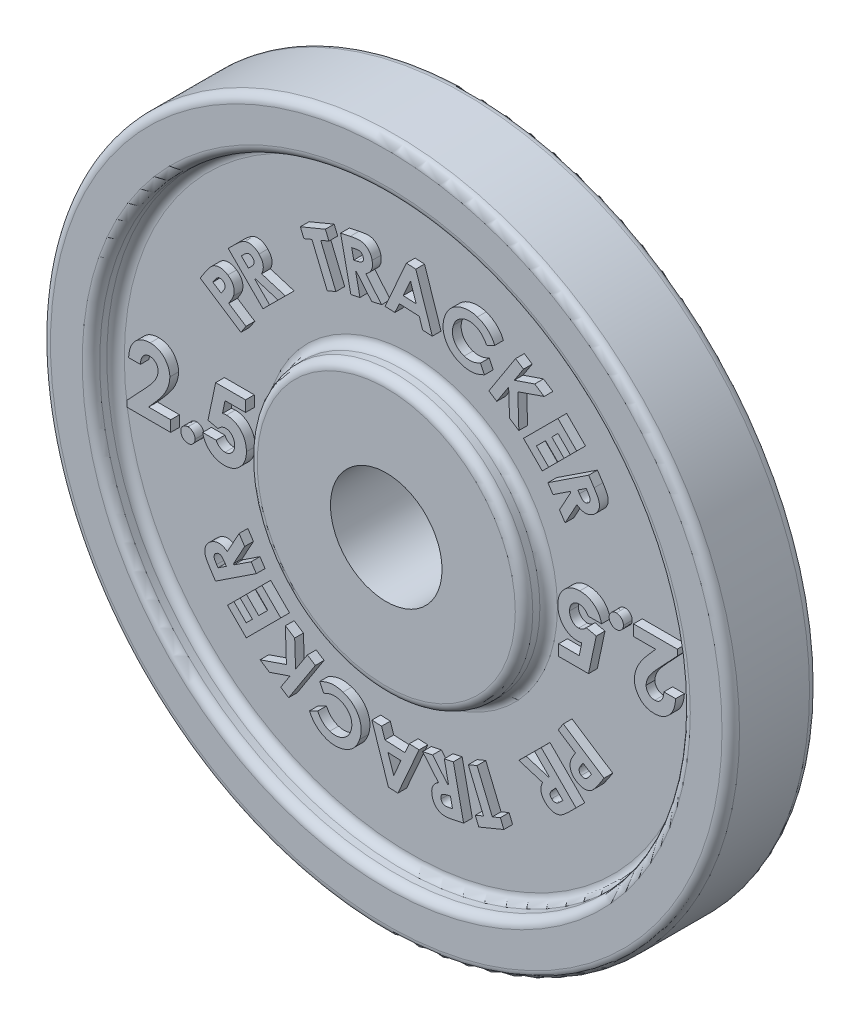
from build123d import *

# Parameters (mm, degrees)
ESBO_O1_R                = 15.75
ESBO_O1_R_2              = 2.55
RESSALTO_EXTRUS_O1_DEPTH = 4
ESBO_O2_R                = 13.5
ESBO_O2_R_2              = 6.3
CORTE_EXTRUS_O1_DEPTH    = 1.125
FILETE1_R                = 0.4
RESSALTO_EXTRUS_O2_DEPTH = 0.4
RESSALTO_EXTRUS_O3_DEPTH = 0.4
PADR_OCIRCULAR1_COUNT    = 2
FILETE2_R                = 0.4
FILETE3_R                = 0.4
RESSALTO_EXTRUS_O4_DEPTH = 0.4
RESSALTO_EXTRUS_O5_DEPTH = 0.4
PADR_OCIRCULAR2_COUNT    = 2


with BuildPart() as part:
    # Esbo_o1 → Ressalto-extrus_o1 (new body)
    with BuildSketch(Plane.XY):
        Circle(ESBO_O1_R)
        Circle(ESBO_O1_R_2, mode=Mode.SUBTRACT)
    extrude(amount=RESSALTO_EXTRUS_O1_DEPTH)

    # Esbo_o2 → Corte-extrus_o1 (cut)
    with BuildSketch(Plane.XY.offset(4)):
        Circle(ESBO_O2_R)
        Circle(ESBO_O2_R_2, mode=Mode.SUBTRACT)
    corte_extrus_o1 = extrude(amount=-CORTE_EXTRUS_O1_DEPTH, mode=Mode.SUBTRACT)

    # Filete1
    filete1_edges = [part.edges().sort_by_distance(p)[0] for p in [
        (-6.3, 0, 4),
        (-13.5, 0, 2.875),
        (-6.3, 0, 2.875),
        (-13.5, 0, 4),
    ]]
    fillet(filete1_edges, radius=FILETE1_R)

    # Esbo_o3 → Ressalto-extrus_o2 (add)
    # profile 1 of 9: a face of its own
    with BuildSketch(Plane.XY.offset(2.875)):
        with BuildLine():
            Line((8.529079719, 6.36202261), (8.776976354, 5.985670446))
            add(Edge.make_bspline(
                [(8.776976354, 5.985670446), (8.79314712, 5.960641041), (8.824321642, 5.912388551), (8.867732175, 5.841856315), (8.9052576, 5.775516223), (8.937201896, 5.713626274), (8.964845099, 5.656554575), (8.985653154, 5.603307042), (9.002690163, 5.554998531), (9.016219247, 5.496400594), (9.02384532, 5.425778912), (9.02000192, 5.341560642), (9.001323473, 5.257880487), (8.975268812, 5.189693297), (8.948894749, 5.136086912), (8.924756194, 5.097479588), (8.898053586, 5.060207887), (8.868173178, 5.024554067), (8.835182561, 4.990230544), (8.799139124, 4.957493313), (8.760273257, 4.92593395), (8.732213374, 4.907176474), (8.717931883, 4.897629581)],
                knots=[0, 0, 0, 0, 1.424579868, 2.746350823, 3.958867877, 5.067175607, 6.076040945, 6.988342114, 7.799210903, 8.522229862, 9.85875015, 11.181925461, 12.534388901, 13.939130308, 14.6618638, 15.387446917, 16.113030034, 16.852417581, 17.609320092, 18.387197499, 19.179140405, 20, 20, 20, 20], degree=3))
            add(Edge.make_bspline(
                [(8.717931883, 4.897629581), (8.702738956, 4.887940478), (8.672920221, 4.868923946), (8.62685385, 4.844775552), (8.581076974, 4.824039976), (8.535099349, 4.808141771), (8.489486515, 4.794990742), (8.44366946, 4.787181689), (8.398038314, 4.782424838), (8.352327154, 4.782042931), (8.306763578, 4.785590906), (8.261269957, 4.793494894), (8.215718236, 4.804910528), (8.170626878, 4.821870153), (8.12484562, 4.840704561), (8.079784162, 4.865103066), (8.0345161, 4.892944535), (8.005352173, 4.914250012), (7.99046794, 4.925123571)],
                knots=[0, 0, 0, 0, 1.102086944, 2.163035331, 3.179481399, 4.173821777, 5.137300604, 6.080390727, 7.013391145, 7.941897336, 8.873265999, 9.805722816, 10.76445368, 11.741476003, 12.750579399, 13.790977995, 14.872593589, 16, 16, 16, 16], degree=3))
            Line((7.99046794, 4.925123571), (7.452306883, 3.937593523))
            Line((7.452306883, 3.937593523), (7.196747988, 4.325213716))
            Line((7.196747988, 4.325213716), (7.709668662, 5.265418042))
            Line((7.709668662, 5.265418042), (7.688034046, 5.298771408))
            Line((7.688034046, 5.298771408), (6.898370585, 4.778188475))
            Line((6.898370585, 4.778188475), (6.664446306, 5.132906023))
            Line((6.664446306, 5.132906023), (8.529079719, 6.36202261))
        make_face()
        with BuildLine():
            Line((8.034187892, 5.526836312), (8.10765544, 5.415057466))
            add(Edge.make_bspline(
                [(8.10765544, 5.415057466), (8.116671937, 5.401431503), (8.133981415, 5.375272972), (8.161251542, 5.339284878), (8.187146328, 5.307174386), (8.212498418, 5.279531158), (8.236840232, 5.256007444), (8.260158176, 5.236214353), (8.28330042, 5.221304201), (8.312395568, 5.206691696), (8.350741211, 5.197410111), (8.398719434, 5.199515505), (8.448314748, 5.215384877), (8.479252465, 5.233915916), (8.495726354, 5.243783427)],
                knots=[0, 0, 0, 0, 1.203101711, 2.309662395, 3.324143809, 4.240453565, 5.070005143, 5.816667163, 6.488851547, 7.092611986, 8.2090873, 9.349703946, 10.588755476, 12, 12, 12, 12], degree=3))
            add(Edge.make_bspline(
                [(8.495726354, 5.243783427), (8.505257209, 5.250575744), (8.524057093, 5.263973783), (8.547957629, 5.288253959), (8.566738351, 5.315590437), (8.581296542, 5.344806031), (8.590699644, 5.375918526), (8.595140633, 5.407834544), (8.595338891, 5.440360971), (8.589496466, 5.475143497), (8.575626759, 5.514753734), (8.55293394, 5.562092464), (8.520613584, 5.618853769), (8.49460372, 5.659040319), (8.480401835, 5.680982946)],
                knots=[0, 0, 0, 0, 0.842179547, 1.661223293, 2.4389524, 3.223208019, 4.003944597, 4.769372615, 5.537932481, 6.338747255, 7.29721474, 8.551489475, 10.117047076, 12, 12, 12, 12], degree=3))
            Line((8.480401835, 5.680982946), (8.41594871, 5.778789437))
            Line((8.41594871, 5.778789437), (8.034187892, 5.526836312))
        make_face(mode=Mode.SUBTRACT)
    # profile 2 of 9: a face of its own
    with BuildSketch(Plane.XY.offset(2.875)):
        Polygon((7.122848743, 7.904349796), (7.982824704, 7.044373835), (7.689405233, 6.750954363), (7.127355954, 7.313003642), (6.842500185, 7.028147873), (7.404549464, 6.466098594), (7.116538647, 6.178087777), (6.554489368, 6.740137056), (6.140276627, 6.325924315), (6.702325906, 5.763875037), (6.408004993, 5.469554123), (5.548029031, 6.329530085), align=None)
    # profile 3 of 9: a face of its own
    with BuildSketch(Plane.XY.offset(2.875)):
        Polygon((5.185765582, 9.30344327), (5.548596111, 9.06906827), (5.128974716, 8.420480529), (6.06016462, 8.737788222), (6.491955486, 8.458341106), (5.289882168, 8.044128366), (5.336306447, 6.531958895), (4.910825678, 6.806898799), (4.870711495, 8.020690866), (4.328944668, 7.183701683), (3.96611414, 7.418076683), align=None)
    # profile 4 of 9: a face of its own
    with BuildSketch(Plane.XY.offset(2.875)):
        with BuildLine():
            Line((4.23243435, 9.349117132), (3.859237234, 9.170631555))
            add(Edge.make_bspline(
                [(3.859237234, 9.170631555), (3.843180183, 9.202978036), (3.811787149, 9.266218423), (3.755298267, 9.353201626), (3.694414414, 9.432110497), (3.627330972, 9.501566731), (3.555640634, 9.563134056), (3.47764861, 9.614738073), (3.394593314, 9.658086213), (3.33577008, 9.67953283), (3.306202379, 9.690313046)],
                knots=[0, 0, 0, 0, 1.108720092, 2.167651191, 3.18060078, 4.166538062, 5.129360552, 6.078037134, 7.033918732, 8, 8, 8, 8], degree=3))
            add(Edge.make_bspline(
                [(3.306202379, 9.690313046), (3.280929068, 9.697820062), (3.231183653, 9.712596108), (3.155574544, 9.726791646), (3.080955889, 9.732271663), (3.007096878, 9.731919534), (2.934181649, 9.722535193), (2.861958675, 9.706342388), (2.790832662, 9.682250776), (2.721686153, 9.650647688), (2.655203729, 9.613893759), (2.593979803, 9.57052686), (2.537880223, 9.522595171), (2.488127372, 9.468629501), (2.443018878, 9.410464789), (2.404330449, 9.346317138), (2.370661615, 9.27725208), (2.353219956, 9.2283604), (2.344363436, 9.2035342)],
                knots=[0, 0, 0, 0, 1.052060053, 2.070767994, 3.063437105, 4.035120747, 5.014106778, 5.991861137, 6.985689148, 8.005720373, 9.023421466, 10.013478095, 10.995783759, 11.96331235, 12.938580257, 13.929127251, 14.948452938, 16, 16, 16, 16], degree=3))
            add(Edge.make_bspline(
                [(2.344363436, 9.2035342), (2.338874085, 9.185869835), (2.32807291, 9.151112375), (2.316041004, 9.098500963), (2.306954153, 9.046602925), (2.300959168, 8.995145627), (2.298658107, 8.944081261), (2.30017311, 8.893501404), (2.304457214, 8.843468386), (2.312750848, 8.79426517), (2.323938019, 8.74606154), (2.338309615, 8.699188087), (2.355995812, 8.653866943), (2.376924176, 8.60996958), (2.400609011, 8.567197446), (2.427804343, 8.526233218), (2.457816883, 8.486556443), (2.490912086, 8.448723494), (2.526579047, 8.4124221), (2.564641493, 8.378976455), (2.604750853, 8.347829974), (2.647135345, 8.319744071), (2.691388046, 8.293167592), (2.738157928, 8.270183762), (2.786719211, 8.248895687), (2.820379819, 8.237539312), (2.837452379, 8.231779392)],
                knots=[0, 0, 0, 0, 1.08983963, 2.1444336, 3.178001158, 4.193971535, 5.19552419, 6.187598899, 7.174443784, 8.152670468, 9.125633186, 10.089121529, 11.039541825, 11.990127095, 12.953371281, 13.918526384, 14.88546701, 15.883372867, 16.878918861, 17.882661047, 18.867398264, 19.869381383, 20.877721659, 21.907298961, 22.938588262, 24, 24, 24, 24], degree=3))
            add(Edge.make_bspline(
                [(2.837452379, 8.231779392), (2.866593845, 8.223055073), (2.923935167, 8.205888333), (3.011354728, 8.191010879), (3.097618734, 8.18629148), (3.169068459, 8.189010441), (3.226462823, 8.197813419), (3.271638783, 8.20675576), (3.318870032, 8.218997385), (3.368038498, 8.234388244), (3.419121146, 8.253012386), (3.472097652, 8.274719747), (3.527347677, 8.299035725), (3.564376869, 8.317134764), (3.583395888, 8.326430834)],
                knots=[0, 0, 0, 0, 1.412340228, 2.779045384, 4.10748043, 5.421237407, 6.091506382, 6.803337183, 7.560088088, 8.35707087, 9.196132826, 10.085318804, 11.016576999, 12, 12, 12, 12], degree=3))
            Line((3.583395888, 8.326430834), (3.765036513, 7.94962795))
            add(Edge.make_bspline(
                [(3.765036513, 7.94962795), (3.739603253, 7.937224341), (3.689785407, 7.912928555), (3.61497754, 7.881279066), (3.542758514, 7.853091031), (3.472727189, 7.829023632), (3.404860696, 7.809319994), (3.339237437, 7.793118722), (3.275809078, 7.782045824), (3.214133, 7.774466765), (3.153142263, 7.771557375), (3.091771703, 7.771533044), (3.029324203, 7.774656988), (2.965964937, 7.78137641), (2.901659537, 7.792047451), (2.836452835, 7.805331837), (2.770361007, 7.822688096), (2.726375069, 7.836330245), (2.704038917, 7.843257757)],
                knots=[0, 0, 0, 0, 1.235616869, 2.420286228, 3.546204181, 4.621062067, 5.653067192, 6.631820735, 7.5714333, 8.463446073, 9.343896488, 10.236271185, 11.14293321, 12.073336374, 13.017223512, 13.98880256, 14.978709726, 16, 16, 16, 16], degree=3))
            add(Edge.make_bspline(
                [(2.704038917, 7.843257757), (2.663795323, 7.85742424), (2.584799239, 7.885232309), (2.473236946, 7.938219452), (2.370761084, 7.999403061), (2.276806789, 8.068119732), (2.191616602, 8.145010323), (2.115466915, 8.230233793), (2.048540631, 8.323554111), (1.991172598, 8.423961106), (1.943311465, 8.529113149), (1.907682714, 8.638176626), (1.882941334, 8.749247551), (1.871046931, 8.86292509), (1.870054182, 8.978573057), (1.881140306, 9.096622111), (1.904146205, 9.216880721), (1.927940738, 9.296416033), (1.940066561, 9.336947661)],
                knots=[0, 0, 0, 0, 1.087256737, 2.134228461, 3.142668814, 4.126448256, 5.097398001, 6.063225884, 7.034900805, 8.019872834, 9.007433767, 9.975333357, 10.94012752, 11.903376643, 12.884071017, 13.884292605, 14.921823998, 16, 16, 16, 16], degree=3))
            add(Edge.make_bspline(
                [(1.940066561, 9.336947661), (1.949032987, 9.363071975), (1.966763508, 9.414731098), (1.999134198, 9.489064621), (2.034527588, 9.559947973), (2.073973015, 9.62686008), (2.116768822, 9.690296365), (2.163848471, 9.749736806), (2.214221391, 9.805980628), (2.269079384, 9.857583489), (2.326559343, 9.906020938), (2.387524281, 9.949730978), (2.451552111, 9.989006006), (2.517862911, 10.024709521), (2.587562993, 10.0554756), (2.659954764, 10.082067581), (2.735474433, 10.103984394), (2.81305506, 10.122110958), (2.892120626, 10.135037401), (2.971590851, 10.143185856), (3.050924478, 10.146449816), (3.129999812, 10.144252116), (3.208522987, 10.136285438), (3.286858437, 10.12427661), (3.36507307, 10.106802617), (3.416426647, 10.090906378), (3.442320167, 10.082891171)],
                knots=[0, 0, 0, 0, 1.061962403, 2.099961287, 3.115586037, 4.107642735, 5.085323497, 6.056407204, 7.021973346, 7.986605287, 8.950665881, 9.911273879, 10.868678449, 11.838127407, 12.805645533, 13.796506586, 14.802219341, 15.828295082, 16.859046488, 17.881389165, 18.899230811, 19.910902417, 20.921170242, 21.932973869, 22.95776332, 24, 24, 24, 24], degree=3))
            add(Edge.make_bspline(
                [(3.442320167, 10.082891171), (3.464202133, 10.075335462), (3.507665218, 10.060327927), (3.571009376, 10.033311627), (3.632749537, 10.003677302), (3.692909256, 9.970776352), (3.75100773, 9.934141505), (3.807415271, 9.894420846), (3.862179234, 9.851565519), (3.914622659, 9.805136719), (3.965084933, 9.75630657), (4.01226903, 9.704685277), (4.057268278, 9.651522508), (4.098685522, 9.595685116), (4.136552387, 9.537218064), (4.171670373, 9.476719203), (4.204499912, 9.414275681), (4.223102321, 9.370884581), (4.23243435, 9.349117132)],
                knots=[0, 0, 0, 0, 0.998866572, 1.984000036, 2.970072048, 3.953860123, 4.941572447, 5.932833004, 6.93037271, 7.941144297, 8.954553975, 9.959547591, 10.958329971, 11.959530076, 12.957722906, 13.963113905, 14.978181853, 16, 16, 16, 16], degree=3))
        make_face()
    # profile 5 of 9: a face of its own
    with BuildSketch(Plane.XY.offset(2.875)):
        Polygon((0.193325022, 10.588317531), (0.625566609, 10.568035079), (1.380975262, 8.289188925), (0.938367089, 8.31037282), (0.785121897, 8.779573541), (-0.127588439, 8.822842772), (-0.331765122, 8.370318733), (-0.774824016, 8.391051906), align=None)
        Polygon((0.384430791, 9.984351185), (0.050446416, 9.230294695), (0.644947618, 9.202349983), align=None, mode=Mode.SUBTRACT)
    # profile 6 of 9: a face of its own
    with BuildSketch(Plane.XY.offset(2.875)):
        with BuildLine():
            Line((-2.811732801, 10.274436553), (-2.368223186, 10.369087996))
            add(Edge.make_bspline(
                [(-2.368223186, 10.369087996), (-2.338961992, 10.375133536), (-2.282535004, 10.386791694), (-2.200562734, 10.400613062), (-2.124680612, 10.411519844), (-2.054978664, 10.419606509), (-1.991314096, 10.423101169), (-1.933854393, 10.423708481), (-1.882448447, 10.421416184), (-1.836330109, 10.414960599), (-1.794013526, 10.405275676), (-1.753758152, 10.392641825), (-1.714870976, 10.37680465), (-1.677319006, 10.357833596), (-1.641309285, 10.33559353), (-1.606186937, 10.310672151), (-1.572689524, 10.282369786), (-1.540587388, 10.251209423), (-1.510544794, 10.217416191), (-1.482270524, 10.181497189), (-1.457686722, 10.142371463), (-1.435124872, 10.10128344), (-1.414601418, 10.058113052), (-1.397790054, 10.012239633), (-1.382516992, 9.964375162), (-1.375037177, 9.93120344), (-1.371227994, 9.914310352)],
                knots=[0, 0, 0, 0, 1.704973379, 3.287853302, 4.742851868, 6.079738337, 7.290568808, 8.379457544, 9.358207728, 10.223935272, 11.033000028, 11.832927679, 12.628986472, 13.426521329, 14.230847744, 15.042135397, 15.881916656, 16.730752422, 17.592991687, 18.460754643, 19.335982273, 20.226199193, 21.135209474, 22.060410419, 23.012241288, 24, 24, 24, 24], degree=3))
            add(Edge.make_bspline(
                [(-1.371227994, 9.914310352), (-1.367904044, 9.896613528), (-1.361367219, 9.861811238), (-1.354613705, 9.809921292), (-1.353295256, 9.759421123), (-1.354131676, 9.710427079), (-1.359952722, 9.663186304), (-1.368011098, 9.617143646), (-1.381606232, 9.573052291), (-1.397577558, 9.530094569), (-1.417575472, 9.488703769), (-1.441681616, 9.449074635), (-1.469082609, 9.410522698), (-1.500971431, 9.374058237), (-1.536228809, 9.338848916), (-1.575038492, 9.304869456), (-1.618027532, 9.272916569), (-1.648603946, 9.253227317), (-1.664196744, 9.243186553)],
                knots=[0, 0, 0, 0, 1.09581435, 2.155011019, 3.179669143, 4.167483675, 5.133737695, 6.073368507, 7.007780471, 7.936629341, 8.860786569, 9.800016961, 10.756576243, 11.735379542, 12.74392103, 13.787214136, 14.871564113, 16, 16, 16, 16], degree=3))
            Line((-1.664196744, 9.243186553), (-0.937183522, 8.377351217))
            Line((-0.937183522, 8.377351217), (-1.393764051, 8.280446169))
            Line((-1.393764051, 8.280446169), (-2.085621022, 9.105716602))
            Line((-2.085621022, 9.105716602), (-2.124383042, 9.097603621))
            Line((-2.124383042, 9.097603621), (-1.926967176, 8.167315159))
            Line((-1.926967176, 8.167315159), (-2.345236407, 8.078072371))
            Line((-2.345236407, 8.078072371), (-2.811732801, 10.274436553))
        make_face()
        with BuildLine():
            Line((-2.210921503, 9.505055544), (-2.079761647, 9.532549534))
            add(Edge.make_bspline(
                [(-2.079761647, 9.532549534), (-2.063814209, 9.536213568), (-2.033161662, 9.543256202), (-1.989337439, 9.554874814), (-1.949728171, 9.567368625), (-1.914422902, 9.580745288), (-1.883658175, 9.595295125), (-1.856805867, 9.610047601), (-1.834035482, 9.625633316), (-1.815538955, 9.642785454), (-1.800427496, 9.660917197), (-1.788511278, 9.680705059), (-1.779428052, 9.702104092), (-1.773232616, 9.725163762), (-1.769455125, 9.749812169), (-1.76931582, 9.776135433), (-1.771470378, 9.804060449), (-1.775040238, 9.822990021), (-1.776877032, 9.832729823)],
                knots=[0, 0, 0, 0, 1.598184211, 3.071867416, 4.427024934, 5.653385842, 6.756228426, 7.748257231, 8.643888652, 9.443485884, 10.204445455, 10.941834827, 11.691389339, 12.467479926, 13.268557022, 14.119810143, 15.03258895, 16, 16, 16, 16], degree=3))
            add(Edge.make_bspline(
                [(-1.776877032, 9.832729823), (-1.77964346, 9.84427505), (-1.785031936, 9.866762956), (-1.799503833, 9.897800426), (-1.817659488, 9.925623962), (-1.839723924, 9.95018809), (-1.865572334, 9.970044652), (-1.89332316, 9.987156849), (-1.92431133, 9.997828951), (-1.951788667, 10.004320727), (-1.976205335, 10.006542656), (-1.997901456, 10.007051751), (-2.022538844, 10.0052902), (-2.050396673, 10.003298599), (-2.081179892, 9.999019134), (-2.11527633, 9.993534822), (-2.1524125, 9.986862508), (-2.178181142, 9.981528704), (-2.191540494, 9.978763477)],
                knots=[0, 0, 0, 0, 1.131166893, 2.203297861, 3.249782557, 4.295873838, 5.337726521, 6.353877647, 7.393258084, 8.45137998, 9.042365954, 9.731131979, 10.521344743, 11.399396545, 12.397667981, 13.487316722, 14.697338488, 16, 16, 16, 16], degree=3))
            Line((-2.191540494, 9.978763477), (-2.306474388, 9.954424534))
            Line((-2.306474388, 9.954424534), (-2.210921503, 9.505055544))
        make_face(mode=Mode.SUBTRACT)
    # profile 7 of 9: a face of its own
    with BuildSketch(Plane.XY.offset(2.875)):
        Polygon((-4.651628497, 9.605944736), (-3.506346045, 10.080554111), (-3.344987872, 9.691581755), (-3.722692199, 9.534730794), (-3.025426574, 7.851738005), (-3.425216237, 7.686323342), (-4.122481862, 9.36931613), (-4.490270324, 9.21697238), align=None)
    # profile 8 of 9: a face of its own
    with BuildSketch(Plane.XY.offset(2.875)):
        with BuildLine():
            Line((-7.949629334, 7.100454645), (-7.627363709, 7.421818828))
            add(Edge.make_bspline(
                [(-7.627363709, 7.421818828), (-7.605987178, 7.44281527), (-7.564737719, 7.483331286), (-7.503519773, 7.539933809), (-7.445885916, 7.590906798), (-7.390976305, 7.63469743), (-7.339987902, 7.673212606), (-7.291869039, 7.70468002), (-7.247074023, 7.730282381), (-7.192227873, 7.756141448), (-7.123636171, 7.777848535), (-7.039455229, 7.790040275), (-6.953139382, 7.788924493), (-6.880602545, 7.777273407), (-6.822765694, 7.761334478), (-6.779497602, 7.745876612), (-6.737337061, 7.726986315), (-6.69591714, 7.704678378), (-6.655516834, 7.678922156), (-6.615670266, 7.65018155), (-6.577316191, 7.617391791), (-6.55272985, 7.593816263), (-6.540224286, 7.581824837)],
                knots=[0, 0, 0, 0, 1.421133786, 2.742306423, 3.954344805, 5.069496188, 6.072872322, 6.984049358, 7.794588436, 8.518273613, 9.856972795, 11.189283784, 12.536208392, 13.936227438, 14.660613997, 15.379652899, 16.113338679, 16.849856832, 17.609021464, 18.384434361, 19.178260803, 20, 20, 20, 20], degree=3))
            add(Edge.make_bspline(
                [(-6.540224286, 7.581824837), (-6.527525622, 7.568808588), (-6.502661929, 7.543323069), (-6.469931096, 7.502335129), (-6.440378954, 7.461247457), (-6.414451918, 7.419456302), (-6.393329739, 7.376473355), (-6.376083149, 7.332884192), (-6.362485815, 7.288767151), (-6.352877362, 7.243823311), (-6.347690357, 7.198101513), (-6.345532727, 7.151662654), (-6.348703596, 7.1043505), (-6.354800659, 7.056251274), (-6.365279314, 7.007424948), (-6.380003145, 6.957964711), (-6.398238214, 6.907554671), (-6.413478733, 6.874391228), (-6.421233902, 6.857515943)],
                knots=[0, 0, 0, 0, 1.103197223, 2.160034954, 3.179906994, 4.174678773, 5.141294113, 6.082891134, 7.017573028, 7.940524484, 8.868105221, 9.808155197, 10.758194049, 11.742332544, 12.749361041, 13.785374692, 14.873083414, 16, 16, 16, 16], degree=3))
            Line((-6.421233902, 6.857515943), (-5.337249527, 6.523982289))
            Line((-5.337249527, 6.523982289), (-5.668980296, 6.193603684))
            Line((-5.668980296, 6.193603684), (-6.701131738, 6.511362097))
            Line((-6.701131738, 6.511362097), (-6.72907645, 6.483417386))
            Line((-6.72907645, 6.483417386), (-6.056149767, 5.807786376))
            Line((-6.056149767, 5.807786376), (-6.359935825, 5.504901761))
            Line((-6.359935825, 5.504901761), (-7.949629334, 7.100454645))
        make_face()
        with BuildLine():
            Line((-7.024298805, 6.779541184), (-6.929196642, 6.874192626))
            add(Edge.make_bspline(
                [(-6.929196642, 6.874192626), (-6.917720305, 6.88600473), (-6.895645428, 6.908725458), (-6.864897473, 6.942230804), (-6.838627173, 6.974583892), (-6.815919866, 7.004838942), (-6.797913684, 7.033988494), (-6.783076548, 7.061008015), (-6.772621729, 7.086717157), (-6.76394222, 7.11845687), (-6.762639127, 7.158193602), (-6.773863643, 7.205295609), (-6.799554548, 7.2510743), (-6.824152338, 7.277787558), (-6.837249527, 7.292011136)],
                knots=[0, 0, 0, 0, 1.202674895, 2.313360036, 3.319177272, 4.245179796, 5.073189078, 5.819223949, 6.493567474, 7.094979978, 8.214892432, 9.353828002, 10.591035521, 12, 12, 12, 12], degree=3))
            add(Edge.make_bspline(
                [(-6.837249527, 7.292011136), (-6.845868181, 7.300131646), (-6.862816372, 7.316100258), (-6.892009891, 7.334379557), (-6.922504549, 7.348428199), (-6.954640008, 7.356353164), (-6.987105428, 7.359353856), (-7.019755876, 7.358475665), (-7.051652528, 7.350669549), (-7.078216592, 7.341106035), (-7.09969057, 7.329444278), (-7.118180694, 7.318421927), (-7.137899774, 7.303495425), (-7.160131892, 7.286580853), (-7.183805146, 7.26615179), (-7.209660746, 7.243025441), (-7.237424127, 7.217139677), (-7.256174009, 7.198467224), (-7.265885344, 7.188795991)],
                knots=[0, 0, 0, 0, 1.125004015, 2.212269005, 3.262387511, 4.310165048, 5.344972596, 6.361525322, 7.402641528, 8.457426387, 9.039724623, 9.726656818, 10.504926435, 11.391944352, 12.386519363, 13.4806323, 14.695115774, 16, 16, 16, 16], degree=3))
            Line((-7.265885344, 7.188795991), (-7.349268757, 7.105863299))
            Line((-7.349268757, 7.105863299), (-7.024298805, 6.779541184))
        make_face(mode=Mode.SUBTRACT)
    # profile 9 of 9: a face of its own
    with BuildSketch(Plane.XY.offset(2.875)):
        with BuildLine():
            Line((-9.23165319, 5.283244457), (-8.986010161, 5.659596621))
            add(Edge.make_bspline(
                [(-8.986010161, 5.659596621), (-8.969727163, 5.683998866), (-8.938359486, 5.731007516), (-8.891497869, 5.797967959), (-8.846226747, 5.858482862), (-8.80189154, 5.91195409), (-8.760229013, 5.959566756), (-8.719989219, 6.000464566), (-8.681301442, 6.03482544), (-8.643825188, 6.063402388), (-8.606434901, 6.086822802), (-8.568799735, 6.106673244), (-8.529937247, 6.122899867), (-8.490338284, 6.136787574), (-8.44929706, 6.146217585), (-8.407544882, 6.153914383), (-8.36467948, 6.157221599), (-8.306155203, 6.157936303), (-8.231542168, 6.150148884), (-8.142131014, 6.127520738), (-8.053152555, 6.089775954), (-7.996880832, 6.055761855), (-7.967831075, 6.03820239)],
                knots=[0, 0, 0, 0, 1.407136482, 2.710717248, 3.919990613, 5.030955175, 6.041784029, 6.953954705, 7.781053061, 8.521898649, 9.211703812, 9.895079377, 10.560316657, 11.230338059, 11.905032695, 12.577993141, 13.26504473, 13.964123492, 15.383954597, 16.848671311, 18.373155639, 20, 20, 20, 20], degree=3))
            add(Edge.make_bspline(
                [(-7.967831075, 6.03820239), (-7.952054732, 6.027445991), (-7.921269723, 6.006456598), (-7.878453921, 5.971973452), (-7.840199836, 5.935196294), (-7.80518704, 5.897298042), (-7.775461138, 5.856569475), (-7.748967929, 5.814610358), (-7.726961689, 5.770513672), (-7.7093209, 5.724734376), (-7.695944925, 5.677758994), (-7.685892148, 5.630037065), (-7.680030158, 5.581481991), (-7.678213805, 5.532330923), (-7.680638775, 5.482619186), (-7.686473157, 5.432292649), (-7.696340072, 5.381182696), (-7.706005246, 5.347332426), (-7.710920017, 5.330119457)],
                knots=[0, 0, 0, 0, 1.124608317, 2.194493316, 3.233698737, 4.248804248, 5.229486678, 6.199567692, 7.169325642, 8.127585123, 9.085599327, 10.043777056, 10.997776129, 11.963162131, 12.9377548, 13.92690783, 14.945826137, 16, 16, 16, 16], degree=3))
            add(Edge.make_bspline(
                [(-7.710920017, 5.330119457), (-7.714703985, 5.319106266), (-7.722886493, 5.295291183), (-7.738886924, 5.257827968), (-7.759519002, 5.215973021), (-7.783602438, 5.168920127), (-7.813368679, 5.117792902), (-7.846469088, 5.061355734), (-7.884479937, 5.000675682), (-7.911442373, 4.958843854), (-7.925463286, 4.937090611)],
                knots=[0, 0, 0, 0, 0.622537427, 1.346183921, 2.176173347, 3.117576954, 4.171813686, 5.338785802, 6.616124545, 8, 8, 8, 8], degree=3))
            Line((-7.925463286, 4.937090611), (-7.135799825, 4.422367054))
            Line((-7.135799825, 4.422367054), (-7.367019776, 4.067649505))
            Line((-7.367019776, 4.067649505), (-9.23165319, 5.283244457))
        make_face()
        with BuildLine():
            Line((-8.271617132, 5.162901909), (-8.197698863, 5.276032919))
            add(Edge.make_bspline(
                [(-8.197698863, 5.276032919), (-8.184527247, 5.296617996), (-8.160332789, 5.334429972), (-8.130733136, 5.388164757), (-8.108406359, 5.432648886), (-8.095879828, 5.470697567), (-8.090488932, 5.504209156), (-8.090626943, 5.535499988), (-8.09491727, 5.566351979), (-8.105195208, 5.596008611), (-8.119356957, 5.62451918), (-8.138952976, 5.650627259), (-8.162797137, 5.674871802), (-8.181974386, 5.687999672), (-8.191839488, 5.694752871)],
                knots=[0, 0, 0, 0, 1.82986352, 3.361209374, 4.594483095, 5.551825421, 6.349238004, 7.125730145, 7.888067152, 8.670975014, 9.466161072, 10.26293814, 11.106426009, 12, 12, 12, 12], degree=3))
            add(Edge.make_bspline(
                [(-8.191839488, 5.694752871), (-8.200731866, 5.700238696), (-8.217878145, 5.710816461), (-8.24490935, 5.722561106), (-8.271606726, 5.731001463), (-8.298517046, 5.734978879), (-8.325193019, 5.735476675), (-8.351770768, 5.732314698), (-8.378244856, 5.725076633), (-8.395064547, 5.717243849), (-8.40367843, 5.713232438)],
                knots=[0, 0, 0, 0, 1.120226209, 2.160019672, 3.154816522, 4.117323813, 5.068961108, 6.011122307, 6.981434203, 8, 8, 8, 8], degree=3))
            add(Edge.make_bspline(
                [(-8.40367843, 5.713232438), (-8.410385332, 5.709632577), (-8.424487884, 5.702063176), (-8.445079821, 5.686584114), (-8.466361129, 5.667174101), (-8.489221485, 5.644088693), (-8.512220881, 5.616327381), (-8.537267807, 5.585481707), (-8.562349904, 5.549939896), (-8.579211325, 5.524864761), (-8.588023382, 5.511760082)],
                knots=[0, 0, 0, 0, 0.661727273, 1.391409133, 2.234074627, 3.167977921, 4.216097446, 5.369899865, 6.625466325, 8, 8, 8, 8], degree=3))
            Line((-8.588023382, 5.511760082), (-8.65337795, 5.411699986))
            Line((-8.65337795, 5.411699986), (-8.271617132, 5.162901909))
        make_face(mode=Mode.SUBTRACT)
    ressalto_extrus_o2 = extrude(amount=RESSALTO_EXTRUS_O2_DEPTH)

    # Esbo_o5 → Ressalto-extrus_o3 (add)
    with BuildSketch(Plane.XY.offset(2.875)):
        with BuildLine():
            Line((-11.96419263, 0.5), (-12.502654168, 0.5))
            add(Edge.make_bspline(
                [(-12.502654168, 0.5), (-12.500328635, 0.540731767), (-12.495784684, 0.620319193), (-12.477709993, 0.735922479), (-12.453490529, 0.845154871), (-12.421166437, 0.947634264), (-12.380549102, 1.043323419), (-12.332683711, 1.132548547), (-12.276347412, 1.214839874), (-12.212739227, 1.289800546), (-12.142939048, 1.357048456), (-12.068395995, 1.416674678), (-11.987969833, 1.465876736), (-11.903130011, 1.506365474), (-11.813890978, 1.538714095), (-11.719408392, 1.560341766), (-11.620500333, 1.574988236), (-11.552789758, 1.576269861), (-11.518279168, 1.576923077)],
                knots=[0, 0, 0, 0, 1.199038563, 2.342849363, 3.436047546, 4.486744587, 5.497670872, 6.488682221, 7.459191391, 8.424610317, 9.374430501, 10.305433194, 11.225809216, 12.140057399, 13.06607119, 14.010487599, 14.985989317, 16, 16, 16, 16], degree=3))
            add(Edge.make_bspline(
                [(-11.518279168, 1.576923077), (-11.475917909, 1.575601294), (-11.393218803, 1.573020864), (-11.273050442, 1.551008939), (-11.160826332, 1.514190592), (-11.056628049, 1.462745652), (-10.961342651, 1.397390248), (-10.87498594, 1.319464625), (-10.800169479, 1.227333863), (-10.736418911, 1.124831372), (-10.683449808, 1.01629566), (-10.646331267, 0.904065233), (-10.621933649, 0.791118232), (-10.619331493, 0.715065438), (-10.618038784, 0.677283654)],
                knots=[0, 0, 0, 0, 1.075374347, 2.099382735, 3.09057751, 4.06680945, 5.040638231, 6.016817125, 7.011024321, 8.044445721, 9.0776792, 10.070479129, 11.0414456, 12, 12, 12, 12], degree=3))
            add(Edge.make_bspline(
                [(-10.618038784, 0.677283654), (-10.618542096, 0.654430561), (-10.61955514, 0.608432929), (-10.626598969, 0.538827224), (-10.637166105, 0.467925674), (-10.653098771, 0.395789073), (-10.67296811, 0.322397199), (-10.697072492, 0.247530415), (-10.725971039, 0.171613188), (-10.759181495, 0.093791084), (-10.798801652, 0.013811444), (-10.844933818, -0.069524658), (-10.898802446, -0.156143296), (-10.959756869, -0.246533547), (-11.028093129, -0.340552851), (-11.10414482, -0.437917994), (-11.187036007, -0.538972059), (-11.245866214, -0.60652103), (-11.276091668, -0.641225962)],
                knots=[0, 0, 0, 0, 0.728284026, 1.46585585, 2.227944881, 3.01186502, 3.81876927, 4.650621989, 5.517437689, 6.406905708, 7.346299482, 8.360816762, 9.441613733, 10.596154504, 11.834900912, 13.145207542, 14.533280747, 16, 16, 16, 16], degree=3))
            Line((-11.276091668, -0.641225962), (-11.58919263, -1))
            Line((-11.58919263, -1), (-10.579577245, -1))
            Line((-10.579577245, -1), (-10.579577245, -1.5))
            Line((-10.579577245, -1.5), (-12.579577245, -1.5))
            Line((-12.579577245, -1.5), (-12.579577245, -1.227163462))
            Line((-12.579577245, -1.227163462), (-11.691356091, -0.281850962))
            add(Edge.make_bspline(
                [(-11.691356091, -0.281850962), (-11.665639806, -0.254275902), (-11.615834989, -0.20087119), (-11.544967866, -0.122440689), (-11.48083938, -0.048012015), (-11.424779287, 0.023207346), (-11.373845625, 0.088907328), (-11.330309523, 0.151068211), (-11.293772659, 0.209128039), (-11.254106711, 0.27913805), (-11.2164371, 0.362637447), (-11.181872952, 0.458832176), (-11.160803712, 0.550772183), (-11.15789549, 0.610682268), (-11.156500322, 0.639423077)],
                knots=[0, 0, 0, 0, 1.246127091, 2.413378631, 3.493388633, 4.492180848, 5.408488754, 6.240484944, 6.999099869, 7.674939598, 8.898438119, 10.020720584, 11.050475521, 12, 12, 12, 12], degree=3))
            add(Edge.make_bspline(
                [(-11.156500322, 0.639423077), (-11.157543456, 0.667227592), (-11.159564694, 0.721103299), (-11.181776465, 0.797741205), (-11.216187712, 0.867129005), (-11.264678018, 0.927193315), (-11.323414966, 0.97655214), (-11.391291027, 1.013263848), (-11.467752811, 1.034446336), (-11.521353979, 1.037097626), (-11.548928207, 1.038461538)],
                knots=[0, 0, 0, 0, 1.062038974, 2.057870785, 3.028805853, 4.01125022, 4.991535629, 5.949134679, 6.94496649, 8, 8, 8, 8], degree=3))
            add(Edge.make_bspline(
                [(-11.548928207, 1.038461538), (-11.563173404, 1.037957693), (-11.591217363, 1.036965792), (-11.63243979, 1.030362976), (-11.671665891, 1.018726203), (-11.709332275, 1.003134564), (-11.745036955, 0.982467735), (-11.778689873, 0.956992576), (-11.810645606, 0.927356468), (-11.840757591, 0.893652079), (-11.868163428, 0.856037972), (-11.892505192, 0.814857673), (-11.912631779, 0.770136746), (-11.930351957, 0.722465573), (-11.944018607, 0.671332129), (-11.953969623, 0.617042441), (-11.961534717, 0.559684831), (-11.963290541, 0.520256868), (-11.96419263, 0.5)],
                knots=[0, 0, 0, 0, 0.903469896, 1.778625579, 2.63899355, 3.493148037, 4.358286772, 5.247621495, 6.164656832, 7.118446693, 8.109501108, 9.111810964, 10.146451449, 11.215617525, 12.33435995, 13.498009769, 14.714554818, 16, 16, 16, 16], degree=3))
        make_face()
        with BuildLine():
            add(Edge.make_bspline(
                [(-9.791115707, -0.884615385), (-9.769378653, -0.885807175), (-9.726582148, -0.888153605), (-9.664747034, -0.905664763), (-9.608940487, -0.937126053), (-9.559041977, -0.978161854), (-9.516849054, -1.027533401), (-9.486352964, -1.083835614), (-9.467362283, -1.145432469), (-9.465265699, -1.188363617), (-9.46419263, -1.210336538)],
                knots=[0, 0, 0, 0, 1.016957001, 2.002212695, 2.9757545, 3.99499976, 5.013036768, 5.994806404, 6.97370641, 8, 8, 8, 8], degree=3))
            add(Edge.make_bspline(
                [(-9.46419263, -1.210336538), (-9.465258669, -1.232312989), (-9.467341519, -1.275251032), (-9.486484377, -1.336967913), (-9.516803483, -1.393732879), (-9.559045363, -1.443633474), (-9.60873384, -1.485442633), (-9.664875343, -1.516613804), (-9.726464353, -1.535118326), (-9.76935792, -1.537336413), (-9.791115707, -1.538461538)],
                knots=[0, 0, 0, 0, 1.023218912, 1.999186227, 2.986238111, 4.008388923, 5.030539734, 6.0011649, 6.986089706, 8, 8, 8, 8], degree=3))
            add(Edge.make_bspline(
                [(-9.791115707, -1.538461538), (-9.812878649, -1.537345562), (-9.855782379, -1.535145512), (-9.917467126, -1.516457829), (-9.974023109, -1.485650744), (-10.02372407, -1.44358276), (-10.066154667, -1.393909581), (-10.095611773, -1.336788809), (-10.114932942, -1.2752743), (-10.116987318, -1.232320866), (-10.118038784, -1.210336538)],
                knots=[0, 0, 0, 0, 1.013427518, 1.99788335, 2.976245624, 3.997909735, 5.019573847, 6.001765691, 6.977268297, 8, 8, 8, 8], degree=3))
            add(Edge.make_bspline(
                [(-10.118038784, -1.210336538), (-10.116980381, -1.188355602), (-10.114912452, -1.145408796), (-10.095742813, -1.08401678), (-10.066107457, -1.027355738), (-10.023727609, -0.978212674), (-9.973815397, -0.936919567), (-9.917596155, -0.905818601), (-9.855664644, -0.888126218), (-9.812857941, -0.88579795), (-9.791115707, -0.884615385)],
                knots=[0, 0, 0, 0, 1.025808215, 2.00424526, 2.981110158, 3.998665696, 5.017428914, 5.998734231, 6.983523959, 8, 8, 8, 8], degree=3))
        make_face()
        with BuildLine():
            Line((-8.522485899, 1.5), (-7.156500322, 1.5))
            Line((-7.156500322, 1.5), (-7.156500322, 1))
            Line((-7.156500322, 1), (-8.095803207, 1))
            Line((-8.095803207, 1), (-8.212990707, 0.432692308))
            add(Edge.make_bspline(
                [(-8.212990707, 0.432692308), (-8.197022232, 0.437139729), (-8.16552912, 0.445910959), (-8.118084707, 0.454707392), (-8.072104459, 0.46040896), (-8.041932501, 0.461169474), (-8.027293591, 0.461538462)],
                knots=[0, 0, 0, 0, 1.05461699, 2.079921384, 3.068411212, 4, 4, 4, 4], degree=3))
            add(Edge.make_bspline(
                [(-8.027293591, 0.461538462), (-7.995393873, 0.460807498), (-7.932512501, 0.459366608), (-7.840525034, 0.44568786), (-7.7524416, 0.424144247), (-7.668531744, 0.393418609), (-7.588877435, 0.353428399), (-7.513382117, 0.305051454), (-7.441953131, 0.248202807), (-7.375859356, 0.182846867), (-7.315129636, 0.111084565), (-7.262328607, 0.033466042), (-7.217233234, -0.048901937), (-7.181365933, -0.13653137), (-7.153056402, -0.228871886), (-7.132599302, -0.325982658), (-7.120501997, -0.427978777), (-7.11887075, -0.497563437), (-7.118038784, -0.533052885)],
                knots=[0, 0, 0, 0, 1.01440847, 1.999622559, 2.951875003, 3.895578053, 4.836219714, 5.782137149, 6.743708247, 7.735272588, 8.734977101, 9.730283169, 10.717124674, 11.717316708, 12.737475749, 13.78628267, 14.87096371, 16, 16, 16, 16], degree=3))
            add(Edge.make_bspline(
                [(-7.118038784, -0.533052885), (-7.119055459, -0.56894522), (-7.121061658, -0.63977129), (-7.134150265, -0.743910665), (-7.157251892, -0.843652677), (-7.188984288, -0.939264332), (-7.230789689, -1.030042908), (-7.281066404, -1.116928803), (-7.340664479, -1.19927709), (-7.408999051, -1.2762436), (-7.483287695, -1.346592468), (-7.562387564, -1.408478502), (-7.645742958, -1.460555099), (-7.733355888, -1.502641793), (-7.824723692, -1.535940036), (-7.919874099, -1.560179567), (-8.01926953, -1.574079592), (-8.086746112, -1.575964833), (-8.121043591, -1.576923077)],
                knots=[0, 0, 0, 0, 1.06808661, 2.107647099, 3.116961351, 4.110378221, 5.100014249, 6.085620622, 7.093190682, 8.119403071, 9.144090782, 10.133780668, 11.103064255, 12.062861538, 13.020824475, 13.992378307, 14.979551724, 16, 16, 16, 16], degree=3))
            add(Edge.make_bspline(
                [(-8.121043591, -1.576923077), (-8.151714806, -1.576139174), (-8.212204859, -1.574593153), (-8.301304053, -1.565090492), (-8.387205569, -1.548289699), (-8.469453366, -1.523974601), (-8.548912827, -1.494048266), (-8.624665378, -1.456619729), (-8.697127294, -1.41240168), (-8.766092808, -1.362201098), (-8.83044133, -1.30565209), (-8.889171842, -1.243749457), (-8.942639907, -1.177273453), (-8.989701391, -1.105403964), (-9.030208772, -1.028247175), (-9.066131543, -0.946712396), (-9.095534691, -0.859948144), (-9.110455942, -0.799798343), (-9.118038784, -0.769230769)],
                knots=[0, 0, 0, 0, 1.054957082, 2.080596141, 3.077793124, 4.061112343, 5.027190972, 5.994718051, 6.962465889, 7.943658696, 8.924948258, 9.904494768, 10.875059, 11.855380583, 12.854004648, 13.869083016, 14.917087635, 16, 16, 16, 16], degree=3))
            Line((-9.118038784, -0.769230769), (-8.502654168, -0.769230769))
            add(Edge.make_bspline(
                [(-8.502654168, -0.769230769), (-8.491404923, -0.790412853), (-8.469543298, -0.831577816), (-8.427957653, -0.88623049), (-8.381405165, -0.932835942), (-8.330305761, -0.971849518), (-8.274328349, -1.001077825), (-8.215753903, -1.023243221), (-8.153846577, -1.036051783), (-8.111684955, -1.03765298), (-8.090394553, -1.038461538)],
                knots=[0, 0, 0, 0, 1.104910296, 2.147267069, 3.153527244, 4.136738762, 5.099945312, 6.05603338, 7.018353, 8, 8, 8, 8], degree=3))
            add(Edge.make_bspline(
                [(-8.090394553, -1.038461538), (-8.075555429, -1.037903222), (-8.046359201, -1.036804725), (-8.003343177, -1.030993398), (-7.962282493, -1.019986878), (-7.922871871, -1.004745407), (-7.885005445, -0.98573757), (-7.849226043, -0.961741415), (-7.814911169, -0.93412095), (-7.782583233, -0.902426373), (-7.753303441, -0.867094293), (-7.727628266, -0.829127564), (-7.70467112, -0.789369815), (-7.68766641, -0.746246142), (-7.673740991, -0.701044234), (-7.663485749, -0.653423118), (-7.657357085, -0.603327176), (-7.656789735, -0.569128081), (-7.656500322, -0.551682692)],
                knots=[0, 0, 0, 0, 0.978869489, 1.925942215, 2.855067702, 3.774946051, 4.70828698, 5.642468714, 6.60995405, 7.609372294, 8.622401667, 9.629904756, 10.629323, 11.642352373, 12.678539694, 13.745912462, 14.850161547, 16, 16, 16, 16], degree=3))
            add(Edge.make_bspline(
                [(-7.656500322, -0.551682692), (-7.656836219, -0.53464225), (-7.65749005, -0.501472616), (-7.662898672, -0.452767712), (-7.672574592, -0.406555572), (-7.685758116, -0.362482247), (-7.702634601, -0.32081537), (-7.723258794, -0.28130692), (-7.747718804, -0.244156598), (-7.77614595, -0.210120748), (-7.806460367, -0.178902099), (-7.839027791, -0.151598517), (-7.873554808, -0.12893844), (-7.908968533, -0.109155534), (-7.946682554, -0.094757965), (-7.985848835, -0.084842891), (-8.026426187, -0.077567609), (-8.054103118, -0.077140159), (-8.068158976, -0.076923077)],
                knots=[0, 0, 0, 0, 1.166249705, 2.270133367, 3.348514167, 4.393962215, 5.415026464, 6.420877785, 7.440098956, 8.453121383, 9.451844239, 10.415694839, 11.355045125, 12.27538808, 13.187007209, 14.108269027, 15.039275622, 16, 16, 16, 16], degree=3))
            add(Edge.make_bspline(
                [(-8.068158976, -0.076923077), (-8.083426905, -0.07750241), (-8.11402711, -0.078663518), (-8.159491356, -0.088111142), (-8.204407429, -0.103400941), (-8.249025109, -0.124495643), (-8.292901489, -0.152101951), (-8.337194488, -0.184480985), (-8.380421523, -0.22398539), (-8.407906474, -0.25340836), (-8.422125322, -0.268629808)],
                knots=[0, 0, 0, 0, 0.88288272, 1.769486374, 2.674910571, 3.623812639, 4.617874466, 5.670434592, 6.794841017, 8, 8, 8, 8], degree=3))
            Line((-8.422125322, -0.268629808), (-8.875250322, -0.164663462))
            Line((-8.875250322, -0.164663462), (-8.522485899, 1.5))
        make_face()
    ressalto_extrus_o3 = extrude(amount=RESSALTO_EXTRUS_O3_DEPTH)

    # Padr_oCircular1: Ressalto-extrus_o2, Ressalto-extrus_o3 ×2 about axis
    padr_ocircular1_axis = Axis((0, 0, 4), (0, 0, 1))
    add([ressalto_extrus_o2.rotate(padr_ocircular1_axis, i * 360 / PADR_OCIRCULAR1_COUNT) for i in range(1, PADR_OCIRCULAR1_COUNT)])
    add([ressalto_extrus_o3.rotate(padr_ocircular1_axis, i * 360 / PADR_OCIRCULAR1_COUNT) for i in range(1, PADR_OCIRCULAR1_COUNT)])

    # Filete2
    filete2_edges = [part.edges().sort_by_distance(p)[0] for p in [
        (-15.75, 0, 0),
        (-15.75, 0, 4),
    ]]
    fillet(filete2_edges, radius=FILETE2_R)

    # Espelhar6: Corte-extrus_o1 across plane
    add(corte_extrus_o1.mirror(Plane.XY.offset(2)), mode=Mode.SUBTRACT)

    # Filete3
    filete3_edges = [part.edges().sort_by_distance(p)[0] for p in [
        (-6.3, 0, 1.125),
        (-13.5, 0, 0),
        (-13.5, 0, 1.125),
        (-6.3, 0, 0),
    ]]
    fillet(filete3_edges, radius=FILETE3_R)

    # Esbo_o10 → Ressalto-extrus_o4 (add)
    # profile 1 of 9: a face of its own
    with BuildSketch(Plane(origin=(0, 0, 1.125), x_dir=(-1, 0, 0), z_dir=(0, 0, -1))):
        with BuildLine():
            Line((8.529079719, 6.36202261), (8.776976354, 5.985670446))
            add(Edge.make_bspline(
                [(8.776976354, 5.985670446), (8.79314712, 5.960641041), (8.824321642, 5.912388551), (8.867732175, 5.841856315), (8.9052576, 5.775516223), (8.937201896, 5.713626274), (8.964845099, 5.656554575), (8.985653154, 5.603307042), (9.002690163, 5.554998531), (9.016219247, 5.496400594), (9.02384532, 5.425778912), (9.02000192, 5.341560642), (9.001323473, 5.257880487), (8.975268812, 5.189693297), (8.948894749, 5.136086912), (8.924756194, 5.097479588), (8.898053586, 5.060207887), (8.868173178, 5.024554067), (8.835182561, 4.990230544), (8.799139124, 4.957493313), (8.760273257, 4.92593395), (8.732213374, 4.907176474), (8.717931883, 4.897629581)],
                knots=[0, 0, 0, 0, 1.424579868, 2.746350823, 3.958867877, 5.067175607, 6.076040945, 6.988342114, 7.799210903, 8.522229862, 9.85875015, 11.181925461, 12.534388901, 13.939130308, 14.6618638, 15.387446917, 16.113030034, 16.852417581, 17.609320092, 18.387197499, 19.179140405, 20, 20, 20, 20], degree=3))
            add(Edge.make_bspline(
                [(8.717931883, 4.897629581), (8.702738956, 4.887940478), (8.672920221, 4.868923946), (8.62685385, 4.844775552), (8.581076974, 4.824039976), (8.535099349, 4.808141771), (8.489486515, 4.794990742), (8.44366946, 4.787181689), (8.398038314, 4.782424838), (8.352327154, 4.782042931), (8.306763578, 4.785590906), (8.261269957, 4.793494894), (8.215718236, 4.804910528), (8.170626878, 4.821870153), (8.12484562, 4.840704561), (8.079784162, 4.865103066), (8.0345161, 4.892944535), (8.005352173, 4.914250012), (7.99046794, 4.925123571)],
                knots=[0, 0, 0, 0, 1.102086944, 2.163035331, 3.179481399, 4.173821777, 5.137300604, 6.080390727, 7.013391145, 7.941897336, 8.873265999, 9.805722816, 10.76445368, 11.741476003, 12.750579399, 13.790977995, 14.872593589, 16, 16, 16, 16], degree=3))
            Line((7.99046794, 4.925123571), (7.452306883, 3.937593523))
            Line((7.452306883, 3.937593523), (7.196747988, 4.325213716))
            Line((7.196747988, 4.325213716), (7.709668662, 5.265418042))
            Line((7.709668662, 5.265418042), (7.688034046, 5.298771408))
            Line((7.688034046, 5.298771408), (6.898370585, 4.778188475))
            Line((6.898370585, 4.778188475), (6.664446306, 5.132906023))
            Line((6.664446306, 5.132906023), (8.529079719, 6.36202261))
        make_face()
        with BuildLine():
            Line((8.034187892, 5.526836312), (8.10765544, 5.415057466))
            add(Edge.make_bspline(
                [(8.10765544, 5.415057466), (8.116671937, 5.401431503), (8.133981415, 5.375272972), (8.161251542, 5.339284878), (8.187146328, 5.307174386), (8.212498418, 5.279531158), (8.236840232, 5.256007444), (8.260158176, 5.236214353), (8.28330042, 5.221304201), (8.312395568, 5.206691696), (8.350741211, 5.197410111), (8.398719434, 5.199515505), (8.448314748, 5.215384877), (8.479252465, 5.233915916), (8.495726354, 5.243783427)],
                knots=[0, 0, 0, 0, 1.203101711, 2.309662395, 3.324143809, 4.240453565, 5.070005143, 5.816667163, 6.488851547, 7.092611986, 8.2090873, 9.349703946, 10.588755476, 12, 12, 12, 12], degree=3))
            add(Edge.make_bspline(
                [(8.495726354, 5.243783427), (8.505257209, 5.250575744), (8.524057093, 5.263973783), (8.547957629, 5.288253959), (8.566738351, 5.315590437), (8.581296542, 5.344806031), (8.590699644, 5.375918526), (8.595140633, 5.407834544), (8.595338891, 5.440360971), (8.589496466, 5.475143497), (8.575626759, 5.514753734), (8.55293394, 5.562092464), (8.520613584, 5.618853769), (8.49460372, 5.659040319), (8.480401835, 5.680982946)],
                knots=[0, 0, 0, 0, 0.842179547, 1.661223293, 2.4389524, 3.223208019, 4.003944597, 4.769372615, 5.537932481, 6.338747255, 7.29721474, 8.551489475, 10.117047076, 12, 12, 12, 12], degree=3))
            Line((8.480401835, 5.680982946), (8.41594871, 5.778789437))
            Line((8.41594871, 5.778789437), (8.034187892, 5.526836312))
        make_face(mode=Mode.SUBTRACT)
    # profile 2 of 9: a face of its own
    with BuildSketch(Plane(origin=(0, 0, 1.125), x_dir=(-1, 0, 0), z_dir=(0, 0, -1))):
        Polygon((7.122848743, 7.904349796), (7.982824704, 7.044373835), (7.689405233, 6.750954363), (7.127355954, 7.313003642), (6.842500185, 7.028147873), (7.404549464, 6.466098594), (7.116538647, 6.178087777), (6.554489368, 6.740137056), (6.140276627, 6.325924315), (6.702325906, 5.763875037), (6.408004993, 5.469554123), (5.548029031, 6.329530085), align=None)
    # profile 3 of 9: a face of its own
    with BuildSketch(Plane(origin=(0, 0, 1.125), x_dir=(-1, 0, 0), z_dir=(0, 0, -1))):
        Polygon((5.185765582, 9.30344327), (5.548596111, 9.06906827), (5.128974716, 8.420480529), (6.06016462, 8.737788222), (6.491955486, 8.458341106), (5.289882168, 8.044128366), (5.336306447, 6.531958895), (4.910825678, 6.806898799), (4.870711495, 8.020690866), (4.328944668, 7.183701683), (3.96611414, 7.418076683), align=None)
    # profile 4 of 9: a face of its own
    with BuildSketch(Plane(origin=(0, 0, 1.125), x_dir=(-1, 0, 0), z_dir=(0, 0, -1))):
        with BuildLine():
            Line((4.23243435, 9.349117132), (3.859237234, 9.170631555))
            add(Edge.make_bspline(
                [(3.859237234, 9.170631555), (3.843180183, 9.202978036), (3.811787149, 9.266218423), (3.755298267, 9.353201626), (3.694414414, 9.432110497), (3.627330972, 9.501566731), (3.555640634, 9.563134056), (3.47764861, 9.614738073), (3.394593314, 9.658086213), (3.33577008, 9.67953283), (3.306202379, 9.690313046)],
                knots=[0, 0, 0, 0, 1.108720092, 2.167651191, 3.18060078, 4.166538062, 5.129360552, 6.078037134, 7.033918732, 8, 8, 8, 8], degree=3))
            add(Edge.make_bspline(
                [(3.306202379, 9.690313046), (3.280929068, 9.697820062), (3.231183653, 9.712596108), (3.155574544, 9.726791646), (3.080955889, 9.732271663), (3.007096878, 9.731919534), (2.934181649, 9.722535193), (2.861958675, 9.706342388), (2.790832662, 9.682250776), (2.721686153, 9.650647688), (2.655203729, 9.613893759), (2.593979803, 9.57052686), (2.537880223, 9.522595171), (2.488127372, 9.468629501), (2.443018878, 9.410464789), (2.404330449, 9.346317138), (2.370661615, 9.27725208), (2.353219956, 9.2283604), (2.344363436, 9.2035342)],
                knots=[0, 0, 0, 0, 1.052060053, 2.070767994, 3.063437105, 4.035120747, 5.014106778, 5.991861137, 6.985689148, 8.005720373, 9.023421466, 10.013478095, 10.995783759, 11.96331235, 12.938580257, 13.929127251, 14.948452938, 16, 16, 16, 16], degree=3))
            add(Edge.make_bspline(
                [(2.344363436, 9.2035342), (2.338874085, 9.185869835), (2.32807291, 9.151112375), (2.316041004, 9.098500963), (2.306954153, 9.046602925), (2.300959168, 8.995145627), (2.298658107, 8.944081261), (2.30017311, 8.893501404), (2.304457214, 8.843468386), (2.312750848, 8.79426517), (2.323938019, 8.74606154), (2.338309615, 8.699188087), (2.355995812, 8.653866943), (2.376924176, 8.60996958), (2.400609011, 8.567197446), (2.427804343, 8.526233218), (2.457816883, 8.486556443), (2.490912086, 8.448723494), (2.526579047, 8.4124221), (2.564641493, 8.378976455), (2.604750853, 8.347829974), (2.647135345, 8.319744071), (2.691388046, 8.293167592), (2.738157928, 8.270183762), (2.786719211, 8.248895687), (2.820379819, 8.237539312), (2.837452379, 8.231779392)],
                knots=[0, 0, 0, 0, 1.08983963, 2.1444336, 3.178001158, 4.193971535, 5.19552419, 6.187598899, 7.174443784, 8.152670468, 9.125633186, 10.089121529, 11.039541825, 11.990127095, 12.953371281, 13.918526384, 14.88546701, 15.883372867, 16.878918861, 17.882661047, 18.867398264, 19.869381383, 20.877721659, 21.907298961, 22.938588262, 24, 24, 24, 24], degree=3))
            add(Edge.make_bspline(
                [(2.837452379, 8.231779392), (2.866593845, 8.223055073), (2.923935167, 8.205888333), (3.011354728, 8.191010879), (3.097618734, 8.18629148), (3.169068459, 8.189010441), (3.226462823, 8.197813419), (3.271638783, 8.20675576), (3.318870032, 8.218997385), (3.368038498, 8.234388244), (3.419121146, 8.253012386), (3.472097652, 8.274719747), (3.527347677, 8.299035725), (3.564376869, 8.317134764), (3.583395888, 8.326430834)],
                knots=[0, 0, 0, 0, 1.412340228, 2.779045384, 4.10748043, 5.421237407, 6.091506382, 6.803337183, 7.560088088, 8.35707087, 9.196132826, 10.085318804, 11.016576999, 12, 12, 12, 12], degree=3))
            Line((3.583395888, 8.326430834), (3.765036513, 7.94962795))
            add(Edge.make_bspline(
                [(3.765036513, 7.94962795), (3.739603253, 7.937224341), (3.689785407, 7.912928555), (3.61497754, 7.881279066), (3.542758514, 7.853091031), (3.472727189, 7.829023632), (3.404860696, 7.809319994), (3.339237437, 7.793118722), (3.275809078, 7.782045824), (3.214133, 7.774466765), (3.153142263, 7.771557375), (3.091771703, 7.771533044), (3.029324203, 7.774656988), (2.965964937, 7.78137641), (2.901659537, 7.792047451), (2.836452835, 7.805331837), (2.770361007, 7.822688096), (2.726375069, 7.836330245), (2.704038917, 7.843257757)],
                knots=[0, 0, 0, 0, 1.235616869, 2.420286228, 3.546204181, 4.621062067, 5.653067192, 6.631820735, 7.5714333, 8.463446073, 9.343896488, 10.236271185, 11.14293321, 12.073336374, 13.017223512, 13.98880256, 14.978709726, 16, 16, 16, 16], degree=3))
            add(Edge.make_bspline(
                [(2.704038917, 7.843257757), (2.663795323, 7.85742424), (2.584799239, 7.885232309), (2.473236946, 7.938219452), (2.370761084, 7.999403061), (2.276806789, 8.068119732), (2.191616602, 8.145010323), (2.115466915, 8.230233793), (2.048540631, 8.323554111), (1.991172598, 8.423961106), (1.943311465, 8.529113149), (1.907682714, 8.638176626), (1.882941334, 8.749247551), (1.871046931, 8.86292509), (1.870054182, 8.978573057), (1.881140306, 9.096622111), (1.904146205, 9.216880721), (1.927940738, 9.296416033), (1.940066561, 9.336947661)],
                knots=[0, 0, 0, 0, 1.087256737, 2.134228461, 3.142668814, 4.126448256, 5.097398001, 6.063225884, 7.034900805, 8.019872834, 9.007433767, 9.975333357, 10.94012752, 11.903376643, 12.884071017, 13.884292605, 14.921823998, 16, 16, 16, 16], degree=3))
            add(Edge.make_bspline(
                [(1.940066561, 9.336947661), (1.949032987, 9.363071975), (1.966763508, 9.414731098), (1.999134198, 9.489064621), (2.034527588, 9.559947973), (2.073973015, 9.62686008), (2.116768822, 9.690296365), (2.163848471, 9.749736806), (2.214221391, 9.805980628), (2.269079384, 9.857583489), (2.326559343, 9.906020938), (2.387524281, 9.949730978), (2.451552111, 9.989006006), (2.517862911, 10.024709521), (2.587562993, 10.0554756), (2.659954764, 10.082067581), (2.735474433, 10.103984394), (2.81305506, 10.122110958), (2.892120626, 10.135037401), (2.971590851, 10.143185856), (3.050924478, 10.146449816), (3.129999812, 10.144252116), (3.208522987, 10.136285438), (3.286858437, 10.12427661), (3.36507307, 10.106802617), (3.416426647, 10.090906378), (3.442320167, 10.082891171)],
                knots=[0, 0, 0, 0, 1.061962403, 2.099961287, 3.115586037, 4.107642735, 5.085323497, 6.056407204, 7.021973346, 7.986605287, 8.950665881, 9.911273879, 10.868678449, 11.838127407, 12.805645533, 13.796506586, 14.802219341, 15.828295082, 16.859046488, 17.881389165, 18.899230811, 19.910902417, 20.921170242, 21.932973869, 22.95776332, 24, 24, 24, 24], degree=3))
            add(Edge.make_bspline(
                [(3.442320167, 10.082891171), (3.464202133, 10.075335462), (3.507665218, 10.060327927), (3.571009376, 10.033311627), (3.632749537, 10.003677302), (3.692909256, 9.970776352), (3.75100773, 9.934141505), (3.807415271, 9.894420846), (3.862179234, 9.851565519), (3.914622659, 9.805136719), (3.965084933, 9.75630657), (4.01226903, 9.704685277), (4.057268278, 9.651522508), (4.098685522, 9.595685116), (4.136552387, 9.537218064), (4.171670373, 9.476719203), (4.204499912, 9.414275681), (4.223102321, 9.370884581), (4.23243435, 9.349117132)],
                knots=[0, 0, 0, 0, 0.998866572, 1.984000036, 2.970072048, 3.953860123, 4.941572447, 5.932833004, 6.93037271, 7.941144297, 8.954553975, 9.959547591, 10.958329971, 11.959530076, 12.957722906, 13.963113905, 14.978181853, 16, 16, 16, 16], degree=3))
        make_face()
    # profile 5 of 9: a face of its own
    with BuildSketch(Plane(origin=(0, 0, 1.125), x_dir=(-1, 0, 0), z_dir=(0, 0, -1))):
        Polygon((0.193325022, 10.588317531), (0.625566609, 10.568035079), (1.380975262, 8.289188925), (0.938367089, 8.31037282), (0.785121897, 8.779573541), (-0.127588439, 8.822842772), (-0.331765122, 8.370318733), (-0.774824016, 8.391051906), align=None)
        Polygon((0.384430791, 9.984351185), (0.050446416, 9.230294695), (0.644947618, 9.202349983), align=None, mode=Mode.SUBTRACT)
    # profile 6 of 9: a face of its own
    with BuildSketch(Plane(origin=(0, 0, 1.125), x_dir=(-1, 0, 0), z_dir=(0, 0, -1))):
        with BuildLine():
            Line((-2.811732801, 10.274436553), (-2.368223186, 10.369087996))
            add(Edge.make_bspline(
                [(-2.368223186, 10.369087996), (-2.338961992, 10.375133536), (-2.282535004, 10.386791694), (-2.200562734, 10.400613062), (-2.124680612, 10.411519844), (-2.054978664, 10.419606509), (-1.991314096, 10.423101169), (-1.933854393, 10.423708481), (-1.882448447, 10.421416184), (-1.836330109, 10.414960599), (-1.794013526, 10.405275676), (-1.753758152, 10.392641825), (-1.714870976, 10.37680465), (-1.677319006, 10.357833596), (-1.641309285, 10.33559353), (-1.606186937, 10.310672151), (-1.572689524, 10.282369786), (-1.540587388, 10.251209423), (-1.510544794, 10.217416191), (-1.482270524, 10.181497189), (-1.457686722, 10.142371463), (-1.435124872, 10.10128344), (-1.414601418, 10.058113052), (-1.397790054, 10.012239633), (-1.382516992, 9.964375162), (-1.375037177, 9.93120344), (-1.371227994, 9.914310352)],
                knots=[0, 0, 0, 0, 1.704973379, 3.287853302, 4.742851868, 6.079738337, 7.290568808, 8.379457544, 9.358207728, 10.223935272, 11.033000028, 11.832927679, 12.628986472, 13.426521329, 14.230847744, 15.042135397, 15.881916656, 16.730752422, 17.592991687, 18.460754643, 19.335982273, 20.226199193, 21.135209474, 22.060410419, 23.012241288, 24, 24, 24, 24], degree=3))
            add(Edge.make_bspline(
                [(-1.371227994, 9.914310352), (-1.367904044, 9.896613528), (-1.361367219, 9.861811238), (-1.354613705, 9.809921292), (-1.353295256, 9.759421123), (-1.354131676, 9.710427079), (-1.359952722, 9.663186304), (-1.368011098, 9.617143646), (-1.381606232, 9.573052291), (-1.397577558, 9.530094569), (-1.417575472, 9.488703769), (-1.441681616, 9.449074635), (-1.469082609, 9.410522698), (-1.500971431, 9.374058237), (-1.536228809, 9.338848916), (-1.575038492, 9.304869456), (-1.618027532, 9.272916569), (-1.648603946, 9.253227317), (-1.664196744, 9.243186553)],
                knots=[0, 0, 0, 0, 1.09581435, 2.155011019, 3.179669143, 4.167483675, 5.133737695, 6.073368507, 7.007780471, 7.936629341, 8.860786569, 9.800016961, 10.756576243, 11.735379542, 12.74392103, 13.787214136, 14.871564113, 16, 16, 16, 16], degree=3))
            Line((-1.664196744, 9.243186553), (-0.937183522, 8.377351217))
            Line((-0.937183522, 8.377351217), (-1.393764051, 8.280446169))
            Line((-1.393764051, 8.280446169), (-2.085621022, 9.105716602))
            Line((-2.085621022, 9.105716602), (-2.124383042, 9.097603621))
            Line((-2.124383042, 9.097603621), (-1.926967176, 8.167315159))
            Line((-1.926967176, 8.167315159), (-2.345236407, 8.078072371))
            Line((-2.345236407, 8.078072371), (-2.811732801, 10.274436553))
        make_face()
        with BuildLine():
            Line((-2.210921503, 9.505055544), (-2.079761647, 9.532549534))
            add(Edge.make_bspline(
                [(-2.079761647, 9.532549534), (-2.063814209, 9.536213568), (-2.033161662, 9.543256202), (-1.989337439, 9.554874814), (-1.949728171, 9.567368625), (-1.914422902, 9.580745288), (-1.883658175, 9.595295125), (-1.856805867, 9.610047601), (-1.834035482, 9.625633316), (-1.815538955, 9.642785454), (-1.800427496, 9.660917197), (-1.788511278, 9.680705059), (-1.779428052, 9.702104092), (-1.773232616, 9.725163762), (-1.769455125, 9.749812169), (-1.76931582, 9.776135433), (-1.771470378, 9.804060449), (-1.775040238, 9.822990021), (-1.776877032, 9.832729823)],
                knots=[0, 0, 0, 0, 1.598184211, 3.071867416, 4.427024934, 5.653385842, 6.756228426, 7.748257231, 8.643888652, 9.443485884, 10.204445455, 10.941834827, 11.691389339, 12.467479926, 13.268557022, 14.119810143, 15.03258895, 16, 16, 16, 16], degree=3))
            add(Edge.make_bspline(
                [(-1.776877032, 9.832729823), (-1.77964346, 9.84427505), (-1.785031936, 9.866762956), (-1.799503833, 9.897800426), (-1.817659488, 9.925623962), (-1.839723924, 9.95018809), (-1.865572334, 9.970044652), (-1.89332316, 9.987156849), (-1.92431133, 9.997828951), (-1.951788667, 10.004320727), (-1.976205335, 10.006542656), (-1.997901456, 10.007051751), (-2.022538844, 10.0052902), (-2.050396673, 10.003298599), (-2.081179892, 9.999019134), (-2.11527633, 9.993534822), (-2.1524125, 9.986862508), (-2.178181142, 9.981528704), (-2.191540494, 9.978763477)],
                knots=[0, 0, 0, 0, 1.131166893, 2.203297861, 3.249782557, 4.295873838, 5.337726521, 6.353877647, 7.393258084, 8.45137998, 9.042365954, 9.731131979, 10.521344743, 11.399396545, 12.397667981, 13.487316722, 14.697338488, 16, 16, 16, 16], degree=3))
            Line((-2.191540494, 9.978763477), (-2.306474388, 9.954424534))
            Line((-2.306474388, 9.954424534), (-2.210921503, 9.505055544))
        make_face(mode=Mode.SUBTRACT)
    # profile 7 of 9: a face of its own
    with BuildSketch(Plane(origin=(0, 0, 1.125), x_dir=(-1, 0, 0), z_dir=(0, 0, -1))):
        Polygon((-4.651628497, 9.605944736), (-3.506346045, 10.080554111), (-3.344987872, 9.691581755), (-3.722692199, 9.534730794), (-3.025426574, 7.851738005), (-3.425216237, 7.686323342), (-4.122481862, 9.36931613), (-4.490270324, 9.21697238), align=None)
    # profile 8 of 9: a face of its own
    with BuildSketch(Plane(origin=(0, 0, 1.125), x_dir=(-1, 0, 0), z_dir=(0, 0, -1))):
        with BuildLine():
            Line((-7.949629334, 7.100454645), (-7.627363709, 7.421818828))
            add(Edge.make_bspline(
                [(-7.627363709, 7.421818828), (-7.605987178, 7.44281527), (-7.564737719, 7.483331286), (-7.503519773, 7.539933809), (-7.445885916, 7.590906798), (-7.390976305, 7.63469743), (-7.339987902, 7.673212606), (-7.291869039, 7.70468002), (-7.247074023, 7.730282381), (-7.192227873, 7.756141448), (-7.123636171, 7.777848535), (-7.039455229, 7.790040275), (-6.953139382, 7.788924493), (-6.880602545, 7.777273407), (-6.822765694, 7.761334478), (-6.779497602, 7.745876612), (-6.737337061, 7.726986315), (-6.69591714, 7.704678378), (-6.655516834, 7.678922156), (-6.615670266, 7.65018155), (-6.577316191, 7.617391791), (-6.55272985, 7.593816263), (-6.540224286, 7.581824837)],
                knots=[0, 0, 0, 0, 1.421133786, 2.742306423, 3.954344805, 5.069496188, 6.072872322, 6.984049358, 7.794588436, 8.518273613, 9.856972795, 11.189283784, 12.536208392, 13.936227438, 14.660613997, 15.379652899, 16.113338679, 16.849856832, 17.609021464, 18.384434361, 19.178260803, 20, 20, 20, 20], degree=3))
            add(Edge.make_bspline(
                [(-6.540224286, 7.581824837), (-6.527525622, 7.568808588), (-6.502661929, 7.543323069), (-6.469931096, 7.502335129), (-6.440378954, 7.461247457), (-6.414451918, 7.419456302), (-6.393329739, 7.376473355), (-6.376083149, 7.332884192), (-6.362485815, 7.288767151), (-6.352877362, 7.243823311), (-6.347690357, 7.198101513), (-6.345532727, 7.151662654), (-6.348703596, 7.1043505), (-6.354800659, 7.056251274), (-6.365279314, 7.007424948), (-6.380003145, 6.957964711), (-6.398238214, 6.907554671), (-6.413478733, 6.874391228), (-6.421233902, 6.857515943)],
                knots=[0, 0, 0, 0, 1.103197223, 2.160034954, 3.179906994, 4.174678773, 5.141294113, 6.082891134, 7.017573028, 7.940524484, 8.868105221, 9.808155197, 10.758194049, 11.742332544, 12.749361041, 13.785374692, 14.873083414, 16, 16, 16, 16], degree=3))
            Line((-6.421233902, 6.857515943), (-5.337249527, 6.523982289))
            Line((-5.337249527, 6.523982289), (-5.668980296, 6.193603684))
            Line((-5.668980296, 6.193603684), (-6.701131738, 6.511362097))
            Line((-6.701131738, 6.511362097), (-6.72907645, 6.483417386))
            Line((-6.72907645, 6.483417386), (-6.056149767, 5.807786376))
            Line((-6.056149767, 5.807786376), (-6.359935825, 5.504901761))
            Line((-6.359935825, 5.504901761), (-7.949629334, 7.100454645))
        make_face()
        with BuildLine():
            Line((-7.024298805, 6.779541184), (-6.929196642, 6.874192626))
            add(Edge.make_bspline(
                [(-6.929196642, 6.874192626), (-6.917720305, 6.88600473), (-6.895645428, 6.908725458), (-6.864897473, 6.942230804), (-6.838627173, 6.974583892), (-6.815919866, 7.004838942), (-6.797913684, 7.033988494), (-6.783076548, 7.061008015), (-6.772621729, 7.086717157), (-6.76394222, 7.11845687), (-6.762639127, 7.158193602), (-6.773863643, 7.205295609), (-6.799554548, 7.2510743), (-6.824152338, 7.277787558), (-6.837249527, 7.292011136)],
                knots=[0, 0, 0, 0, 1.202674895, 2.313360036, 3.319177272, 4.245179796, 5.073189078, 5.819223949, 6.493567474, 7.094979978, 8.214892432, 9.353828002, 10.591035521, 12, 12, 12, 12], degree=3))
            add(Edge.make_bspline(
                [(-6.837249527, 7.292011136), (-6.845868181, 7.300131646), (-6.862816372, 7.316100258), (-6.892009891, 7.334379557), (-6.922504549, 7.348428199), (-6.954640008, 7.356353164), (-6.987105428, 7.359353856), (-7.019755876, 7.358475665), (-7.051652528, 7.350669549), (-7.078216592, 7.341106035), (-7.09969057, 7.329444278), (-7.118180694, 7.318421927), (-7.137899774, 7.303495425), (-7.160131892, 7.286580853), (-7.183805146, 7.26615179), (-7.209660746, 7.243025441), (-7.237424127, 7.217139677), (-7.256174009, 7.198467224), (-7.265885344, 7.188795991)],
                knots=[0, 0, 0, 0, 1.125004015, 2.212269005, 3.262387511, 4.310165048, 5.344972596, 6.361525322, 7.402641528, 8.457426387, 9.039724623, 9.726656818, 10.504926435, 11.391944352, 12.386519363, 13.4806323, 14.695115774, 16, 16, 16, 16], degree=3))
            Line((-7.265885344, 7.188795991), (-7.349268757, 7.105863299))
            Line((-7.349268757, 7.105863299), (-7.024298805, 6.779541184))
        make_face(mode=Mode.SUBTRACT)
    # profile 9 of 9: a face of its own
    with BuildSketch(Plane(origin=(0, 0, 1.125), x_dir=(-1, 0, 0), z_dir=(0, 0, -1))):
        with BuildLine():
            Line((-9.23165319, 5.283244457), (-8.986010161, 5.659596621))
            add(Edge.make_bspline(
                [(-8.986010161, 5.659596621), (-8.969727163, 5.683998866), (-8.938359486, 5.731007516), (-8.891497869, 5.797967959), (-8.846226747, 5.858482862), (-8.80189154, 5.91195409), (-8.760229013, 5.959566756), (-8.719989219, 6.000464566), (-8.681301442, 6.03482544), (-8.643825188, 6.063402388), (-8.606434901, 6.086822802), (-8.568799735, 6.106673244), (-8.529937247, 6.122899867), (-8.490338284, 6.136787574), (-8.44929706, 6.146217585), (-8.407544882, 6.153914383), (-8.36467948, 6.157221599), (-8.306155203, 6.157936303), (-8.231542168, 6.150148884), (-8.142131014, 6.127520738), (-8.053152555, 6.089775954), (-7.996880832, 6.055761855), (-7.967831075, 6.03820239)],
                knots=[0, 0, 0, 0, 1.407136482, 2.710717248, 3.919990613, 5.030955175, 6.041784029, 6.953954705, 7.781053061, 8.521898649, 9.211703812, 9.895079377, 10.560316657, 11.230338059, 11.905032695, 12.577993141, 13.26504473, 13.964123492, 15.383954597, 16.848671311, 18.373155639, 20, 20, 20, 20], degree=3))
            add(Edge.make_bspline(
                [(-7.967831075, 6.03820239), (-7.952054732, 6.027445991), (-7.921269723, 6.006456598), (-7.878453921, 5.971973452), (-7.840199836, 5.935196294), (-7.80518704, 5.897298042), (-7.775461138, 5.856569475), (-7.748967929, 5.814610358), (-7.726961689, 5.770513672), (-7.7093209, 5.724734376), (-7.695944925, 5.677758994), (-7.685892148, 5.630037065), (-7.680030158, 5.581481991), (-7.678213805, 5.532330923), (-7.680638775, 5.482619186), (-7.686473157, 5.432292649), (-7.696340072, 5.381182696), (-7.706005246, 5.347332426), (-7.710920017, 5.330119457)],
                knots=[0, 0, 0, 0, 1.124608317, 2.194493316, 3.233698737, 4.248804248, 5.229486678, 6.199567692, 7.169325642, 8.127585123, 9.085599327, 10.043777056, 10.997776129, 11.963162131, 12.9377548, 13.92690783, 14.945826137, 16, 16, 16, 16], degree=3))
            add(Edge.make_bspline(
                [(-7.710920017, 5.330119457), (-7.714703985, 5.319106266), (-7.722886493, 5.295291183), (-7.738886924, 5.257827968), (-7.759519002, 5.215973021), (-7.783602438, 5.168920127), (-7.813368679, 5.117792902), (-7.846469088, 5.061355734), (-7.884479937, 5.000675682), (-7.911442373, 4.958843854), (-7.925463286, 4.937090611)],
                knots=[0, 0, 0, 0, 0.622537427, 1.346183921, 2.176173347, 3.117576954, 4.171813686, 5.338785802, 6.616124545, 8, 8, 8, 8], degree=3))
            Line((-7.925463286, 4.937090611), (-7.135799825, 4.422367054))
            Line((-7.135799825, 4.422367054), (-7.367019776, 4.067649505))
            Line((-7.367019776, 4.067649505), (-9.23165319, 5.283244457))
        make_face()
        with BuildLine():
            Line((-8.271617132, 5.162901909), (-8.197698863, 5.276032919))
            add(Edge.make_bspline(
                [(-8.197698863, 5.276032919), (-8.184527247, 5.296617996), (-8.160332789, 5.334429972), (-8.130733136, 5.388164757), (-8.108406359, 5.432648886), (-8.095879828, 5.470697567), (-8.090488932, 5.504209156), (-8.090626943, 5.535499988), (-8.09491727, 5.566351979), (-8.105195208, 5.596008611), (-8.119356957, 5.62451918), (-8.138952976, 5.650627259), (-8.162797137, 5.674871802), (-8.181974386, 5.687999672), (-8.191839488, 5.694752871)],
                knots=[0, 0, 0, 0, 1.82986352, 3.361209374, 4.594483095, 5.551825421, 6.349238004, 7.125730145, 7.888067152, 8.670975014, 9.466161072, 10.26293814, 11.106426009, 12, 12, 12, 12], degree=3))
            add(Edge.make_bspline(
                [(-8.191839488, 5.694752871), (-8.200731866, 5.700238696), (-8.217878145, 5.710816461), (-8.24490935, 5.722561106), (-8.271606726, 5.731001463), (-8.298517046, 5.734978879), (-8.325193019, 5.735476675), (-8.351770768, 5.732314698), (-8.378244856, 5.725076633), (-8.395064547, 5.717243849), (-8.40367843, 5.713232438)],
                knots=[0, 0, 0, 0, 1.120226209, 2.160019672, 3.154816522, 4.117323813, 5.068961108, 6.011122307, 6.981434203, 8, 8, 8, 8], degree=3))
            add(Edge.make_bspline(
                [(-8.40367843, 5.713232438), (-8.410385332, 5.709632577), (-8.424487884, 5.702063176), (-8.445079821, 5.686584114), (-8.466361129, 5.667174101), (-8.489221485, 5.644088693), (-8.512220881, 5.616327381), (-8.537267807, 5.585481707), (-8.562349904, 5.549939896), (-8.579211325, 5.524864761), (-8.588023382, 5.511760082)],
                knots=[0, 0, 0, 0, 0.661727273, 1.391409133, 2.234074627, 3.167977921, 4.216097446, 5.369899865, 6.625466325, 8, 8, 8, 8], degree=3))
            Line((-8.588023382, 5.511760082), (-8.65337795, 5.411699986))
            Line((-8.65337795, 5.411699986), (-8.271617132, 5.162901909))
        make_face(mode=Mode.SUBTRACT)
    ressalto_extrus_o4 = extrude(amount=RESSALTO_EXTRUS_O4_DEPTH)

    # Esbo_o12 → Ressalto-extrus_o5 (add)
    with BuildSketch(Plane(origin=(0, 0, 1.125), x_dir=(-1, 0, 0), z_dir=(0, 0, -1))):
        with BuildLine():
            Line((-11.739408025, 0.5), (-12.277869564, 0.5))
            add(Edge.make_bspline(
                [(-12.277869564, 0.5), (-12.275544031, 0.540731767), (-12.271000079, 0.620319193), (-12.252925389, 0.735922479), (-12.228705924, 0.845154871), (-12.196381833, 0.947634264), (-12.155764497, 1.043323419), (-12.107899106, 1.132548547), (-12.051562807, 1.214839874), (-11.987954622, 1.289800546), (-11.918154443, 1.357048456), (-11.843611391, 1.416674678), (-11.763185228, 1.465876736), (-11.678345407, 1.506365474), (-11.589106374, 1.538714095), (-11.494623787, 1.560341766), (-11.395715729, 1.574988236), (-11.328005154, 1.576269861), (-11.293494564, 1.576923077)],
                knots=[0, 0, 0, 0, 1.199038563, 2.342849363, 3.436047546, 4.486744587, 5.497670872, 6.488682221, 7.459191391, 8.424610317, 9.374430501, 10.305433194, 11.225809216, 12.140057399, 13.06607119, 14.010487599, 14.985989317, 16, 16, 16, 16], degree=3))
            add(Edge.make_bspline(
                [(-11.293494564, 1.576923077), (-11.251133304, 1.575601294), (-11.168434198, 1.573020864), (-11.048265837, 1.551008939), (-10.936041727, 1.514190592), (-10.831843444, 1.462745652), (-10.736558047, 1.397390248), (-10.650201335, 1.319464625), (-10.575384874, 1.227333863), (-10.511634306, 1.124831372), (-10.458665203, 1.01629566), (-10.421546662, 0.904065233), (-10.397149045, 0.791118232), (-10.394546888, 0.715065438), (-10.393254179, 0.677283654)],
                knots=[0, 0, 0, 0, 1.075374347, 2.099382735, 3.09057751, 4.06680945, 5.040638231, 6.016817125, 7.011024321, 8.044445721, 9.0776792, 10.070479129, 11.0414456, 12, 12, 12, 12], degree=3))
            add(Edge.make_bspline(
                [(-10.393254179, 0.677283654), (-10.393757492, 0.654430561), (-10.394770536, 0.608432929), (-10.401814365, 0.538827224), (-10.412381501, 0.467925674), (-10.428314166, 0.395789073), (-10.448183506, 0.322397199), (-10.472287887, 0.247530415), (-10.501186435, 0.171613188), (-10.53439689, 0.093791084), (-10.574017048, 0.013811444), (-10.620149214, -0.069524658), (-10.674017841, -0.156143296), (-10.734972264, -0.246533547), (-10.803308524, -0.340552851), (-10.879360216, -0.437917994), (-10.962251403, -0.538972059), (-11.02108161, -0.60652103), (-11.051307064, -0.641225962)],
                knots=[0, 0, 0, 0, 0.728284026, 1.46585585, 2.227944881, 3.01186502, 3.81876927, 4.650621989, 5.517437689, 6.406905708, 7.346299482, 8.360816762, 9.441613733, 10.596154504, 11.834900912, 13.145207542, 14.533280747, 16, 16, 16, 16], degree=3))
            Line((-11.051307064, -0.641225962), (-11.364408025, -1))
            Line((-11.364408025, -1), (-10.354792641, -1))
            Line((-10.354792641, -1), (-10.354792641, -1.5))
            Line((-10.354792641, -1.5), (-12.354792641, -1.5))
            Line((-12.354792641, -1.5), (-12.354792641, -1.227163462))
            Line((-12.354792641, -1.227163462), (-11.466571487, -0.281850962))
            add(Edge.make_bspline(
                [(-11.466571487, -0.281850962), (-11.440855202, -0.254275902), (-11.391050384, -0.20087119), (-11.320183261, -0.122440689), (-11.256054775, -0.048012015), (-11.199994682, 0.023207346), (-11.149061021, 0.088907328), (-11.105524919, 0.151068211), (-11.068988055, 0.209128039), (-11.029322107, 0.27913805), (-10.991652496, 0.362637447), (-10.957088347, 0.458832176), (-10.936019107, 0.550772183), (-10.933110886, 0.610682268), (-10.931715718, 0.639423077)],
                knots=[0, 0, 0, 0, 1.246127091, 2.413378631, 3.493388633, 4.492180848, 5.408488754, 6.240484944, 6.999099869, 7.674939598, 8.898438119, 10.020720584, 11.050475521, 12, 12, 12, 12], degree=3))
            add(Edge.make_bspline(
                [(-10.931715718, 0.639423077), (-10.932758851, 0.667227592), (-10.934780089, 0.721103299), (-10.956991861, 0.797741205), (-10.991403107, 0.867129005), (-11.039893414, 0.927193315), (-11.098630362, 0.97655214), (-11.166506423, 1.013263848), (-11.242968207, 1.034446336), (-11.296569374, 1.037097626), (-11.324143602, 1.038461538)],
                knots=[0, 0, 0, 0, 1.062038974, 2.057870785, 3.028805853, 4.01125022, 4.991535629, 5.949134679, 6.94496649, 8, 8, 8, 8], degree=3))
            add(Edge.make_bspline(
                [(-11.324143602, 1.038461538), (-11.3383888, 1.037957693), (-11.366432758, 1.036965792), (-11.407655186, 1.030362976), (-11.446881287, 1.018726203), (-11.48454767, 1.003134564), (-11.520252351, 0.982467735), (-11.553905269, 0.956992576), (-11.585861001, 0.927356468), (-11.615972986, 0.893652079), (-11.643378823, 0.856037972), (-11.667720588, 0.814857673), (-11.687847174, 0.770136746), (-11.705567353, 0.722465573), (-11.719234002, 0.671332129), (-11.729185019, 0.617042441), (-11.736750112, 0.559684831), (-11.738505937, 0.520256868), (-11.739408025, 0.5)],
                knots=[0, 0, 0, 0, 0.903469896, 1.778625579, 2.63899355, 3.493148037, 4.358286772, 5.247621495, 6.164656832, 7.118446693, 8.109501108, 9.111810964, 10.146451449, 11.215617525, 12.33435995, 13.498009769, 14.714554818, 16, 16, 16, 16], degree=3))
        make_face()
        with BuildLine():
            add(Edge.make_bspline(
                [(-9.566331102, -0.884615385), (-9.544594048, -0.885807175), (-9.501797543, -0.888153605), (-9.439962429, -0.905664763), (-9.384155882, -0.937126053), (-9.334257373, -0.978161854), (-9.29206445, -1.027533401), (-9.261568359, -1.083835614), (-9.242577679, -1.145432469), (-9.240481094, -1.188363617), (-9.239408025, -1.210336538)],
                knots=[0, 0, 0, 0, 1.016957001, 2.002212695, 2.9757545, 3.99499976, 5.013036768, 5.994806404, 6.97370641, 8, 8, 8, 8], degree=3))
            add(Edge.make_bspline(
                [(-9.239408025, -1.210336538), (-9.240474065, -1.232312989), (-9.242556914, -1.275251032), (-9.261699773, -1.336967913), (-9.292018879, -1.393732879), (-9.334260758, -1.443633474), (-9.383949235, -1.485442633), (-9.440090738, -1.516613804), (-9.501679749, -1.535118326), (-9.544573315, -1.537336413), (-9.566331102, -1.538461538)],
                knots=[0, 0, 0, 0, 1.023218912, 1.999186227, 2.986238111, 4.008388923, 5.030539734, 6.0011649, 6.986089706, 8, 8, 8, 8], degree=3))
            add(Edge.make_bspline(
                [(-9.566331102, -1.538461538), (-9.588094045, -1.537345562), (-9.630997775, -1.535145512), (-9.692682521, -1.516457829), (-9.749238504, -1.485650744), (-9.798939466, -1.44358276), (-9.841370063, -1.393909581), (-9.870827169, -1.336788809), (-9.890148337, -1.2752743), (-9.892202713, -1.232320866), (-9.893254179, -1.210336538)],
                knots=[0, 0, 0, 0, 1.013427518, 1.99788335, 2.976245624, 3.997909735, 5.019573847, 6.001765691, 6.977268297, 8, 8, 8, 8], degree=3))
            add(Edge.make_bspline(
                [(-9.893254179, -1.210336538), (-9.892195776, -1.188355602), (-9.890127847, -1.145408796), (-9.870958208, -1.08401678), (-9.841322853, -1.027355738), (-9.798943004, -0.978212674), (-9.749030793, -0.936919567), (-9.69281155, -0.905818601), (-9.630880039, -0.888126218), (-9.588073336, -0.88579795), (-9.566331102, -0.884615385)],
                knots=[0, 0, 0, 0, 1.025808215, 2.00424526, 2.981110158, 3.998665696, 5.017428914, 5.998734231, 6.983523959, 8, 8, 8, 8], degree=3))
        make_face()
        with BuildLine():
            Line((-8.297701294, 1.5), (-6.931715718, 1.5))
            Line((-6.931715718, 1.5), (-6.931715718, 1))
            Line((-6.931715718, 1), (-7.871018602, 1))
            Line((-7.871018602, 1), (-7.988206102, 0.432692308))
            add(Edge.make_bspline(
                [(-7.988206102, 0.432692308), (-7.972237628, 0.437139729), (-7.940744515, 0.445910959), (-7.893300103, 0.454707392), (-7.847319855, 0.46040896), (-7.817147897, 0.461169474), (-7.802508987, 0.461538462)],
                knots=[0, 0, 0, 0, 1.05461699, 2.079921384, 3.068411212, 4, 4, 4, 4], degree=3))
            add(Edge.make_bspline(
                [(-7.802508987, 0.461538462), (-7.770609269, 0.460807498), (-7.707727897, 0.459366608), (-7.61574043, 0.44568786), (-7.527656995, 0.424144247), (-7.44374714, 0.393418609), (-7.364092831, 0.353428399), (-7.288597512, 0.305051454), (-7.217168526, 0.248202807), (-7.151074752, 0.182846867), (-7.090345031, 0.111084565), (-7.037544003, 0.033466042), (-6.99244863, -0.048901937), (-6.956581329, -0.13653137), (-6.928271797, -0.228871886), (-6.907814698, -0.325982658), (-6.895717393, -0.427978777), (-6.894086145, -0.497563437), (-6.893254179, -0.533052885)],
                knots=[0, 0, 0, 0, 1.01440847, 1.999622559, 2.951875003, 3.895578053, 4.836219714, 5.782137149, 6.743708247, 7.735272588, 8.734977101, 9.730283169, 10.717124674, 11.717316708, 12.737475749, 13.78628267, 14.87096371, 16, 16, 16, 16], degree=3))
            add(Edge.make_bspline(
                [(-6.893254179, -0.533052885), (-6.894270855, -0.56894522), (-6.896277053, -0.63977129), (-6.909365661, -0.743910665), (-6.932467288, -0.843652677), (-6.964199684, -0.939264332), (-7.006005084, -1.030042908), (-7.0562818, -1.116928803), (-7.115879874, -1.19927709), (-7.184214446, -1.2762436), (-7.25850309, -1.346592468), (-7.337602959, -1.408478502), (-7.420958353, -1.460555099), (-7.508571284, -1.502641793), (-7.599939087, -1.535940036), (-7.695089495, -1.560179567), (-7.794484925, -1.574079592), (-7.861961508, -1.575964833), (-7.896258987, -1.576923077)],
                knots=[0, 0, 0, 0, 1.06808661, 2.107647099, 3.116961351, 4.110378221, 5.100014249, 6.085620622, 7.093190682, 8.119403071, 9.144090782, 10.133780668, 11.103064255, 12.062861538, 13.020824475, 13.992378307, 14.979551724, 16, 16, 16, 16], degree=3))
            add(Edge.make_bspline(
                [(-7.896258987, -1.576923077), (-7.926930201, -1.576139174), (-7.987420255, -1.574593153), (-8.076519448, -1.565090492), (-8.162420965, -1.548289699), (-8.244668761, -1.523974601), (-8.324128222, -1.494048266), (-8.399880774, -1.456619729), (-8.472342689, -1.41240168), (-8.541308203, -1.362201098), (-8.605656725, -1.30565209), (-8.664387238, -1.243749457), (-8.717855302, -1.177273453), (-8.764916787, -1.105403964), (-8.805424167, -1.028247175), (-8.841346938, -0.946712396), (-8.870750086, -0.859948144), (-8.885671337, -0.799798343), (-8.893254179, -0.769230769)],
                knots=[0, 0, 0, 0, 1.054957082, 2.080596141, 3.077793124, 4.061112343, 5.027190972, 5.994718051, 6.962465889, 7.943658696, 8.924948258, 9.904494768, 10.875059, 11.855380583, 12.854004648, 13.869083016, 14.917087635, 16, 16, 16, 16], degree=3))
            Line((-8.893254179, -0.769230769), (-8.277869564, -0.769230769))
            add(Edge.make_bspline(
                [(-8.277869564, -0.769230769), (-8.266620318, -0.790412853), (-8.244758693, -0.831577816), (-8.203173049, -0.88623049), (-8.15662056, -0.932835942), (-8.105521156, -0.971849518), (-8.049543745, -1.001077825), (-7.990969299, -1.023243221), (-7.929061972, -1.036051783), (-7.88690035, -1.03765298), (-7.865609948, -1.038461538)],
                knots=[0, 0, 0, 0, 1.104910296, 2.147267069, 3.153527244, 4.136738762, 5.099945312, 6.05603338, 7.018353, 8, 8, 8, 8], degree=3))
            add(Edge.make_bspline(
                [(-7.865609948, -1.038461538), (-7.850770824, -1.037903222), (-7.821574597, -1.036804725), (-7.778558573, -1.030993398), (-7.737497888, -1.019986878), (-7.698087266, -1.004745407), (-7.66022084, -0.98573757), (-7.624441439, -0.961741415), (-7.590126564, -0.93412095), (-7.557798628, -0.902426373), (-7.528518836, -0.867094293), (-7.502843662, -0.829127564), (-7.479886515, -0.789369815), (-7.462881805, -0.746246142), (-7.448956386, -0.701044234), (-7.438701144, -0.653423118), (-7.43257248, -0.603327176), (-7.43200513, -0.569128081), (-7.431715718, -0.551682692)],
                knots=[0, 0, 0, 0, 0.978869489, 1.925942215, 2.855067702, 3.774946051, 4.70828698, 5.642468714, 6.60995405, 7.609372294, 8.622401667, 9.629904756, 10.629323, 11.642352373, 12.678539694, 13.745912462, 14.850161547, 16, 16, 16, 16], degree=3))
            add(Edge.make_bspline(
                [(-7.431715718, -0.551682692), (-7.432051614, -0.53464225), (-7.432705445, -0.501472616), (-7.438114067, -0.452767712), (-7.447789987, -0.406555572), (-7.460973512, -0.362482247), (-7.477849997, -0.32081537), (-7.49847419, -0.28130692), (-7.522934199, -0.244156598), (-7.551361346, -0.210120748), (-7.581675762, -0.178902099), (-7.614243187, -0.151598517), (-7.648770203, -0.12893844), (-7.684183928, -0.109155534), (-7.721897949, -0.094757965), (-7.76106423, -0.084842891), (-7.801641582, -0.077567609), (-7.829318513, -0.077140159), (-7.843374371, -0.076923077)],
                knots=[0, 0, 0, 0, 1.166249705, 2.270133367, 3.348514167, 4.393962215, 5.415026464, 6.420877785, 7.440098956, 8.453121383, 9.451844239, 10.415694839, 11.355045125, 12.27538808, 13.187007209, 14.108269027, 15.039275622, 16, 16, 16, 16], degree=3))
            add(Edge.make_bspline(
                [(-7.843374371, -0.076923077), (-7.8586423, -0.07750241), (-7.889242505, -0.078663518), (-7.934706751, -0.088111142), (-7.979622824, -0.103400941), (-8.024240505, -0.124495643), (-8.068116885, -0.152101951), (-8.112409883, -0.184480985), (-8.155636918, -0.22398539), (-8.18312187, -0.25340836), (-8.197340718, -0.268629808)],
                knots=[0, 0, 0, 0, 0.88288272, 1.769486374, 2.674910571, 3.623812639, 4.617874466, 5.670434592, 6.794841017, 8, 8, 8, 8], degree=3))
            Line((-8.197340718, -0.268629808), (-8.650465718, -0.164663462))
            Line((-8.650465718, -0.164663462), (-8.297701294, 1.5))
        make_face()
    ressalto_extrus_o5 = extrude(amount=RESSALTO_EXTRUS_O5_DEPTH)

    # Padr_oCircular2: Ressalto-extrus_o4, Ressalto-extrus_o5 ×2 about axis
    padr_ocircular2_axis = Axis((0, 0, 0), (0, 0, 1))
    add([ressalto_extrus_o4.rotate(padr_ocircular2_axis, i * 360 / PADR_OCIRCULAR2_COUNT) for i in range(1, PADR_OCIRCULAR2_COUNT)])
    add([ressalto_extrus_o5.rotate(padr_ocircular2_axis, i * 360 / PADR_OCIRCULAR2_COUNT) for i in range(1, PADR_OCIRCULAR2_COUNT)])


solid = part.part
